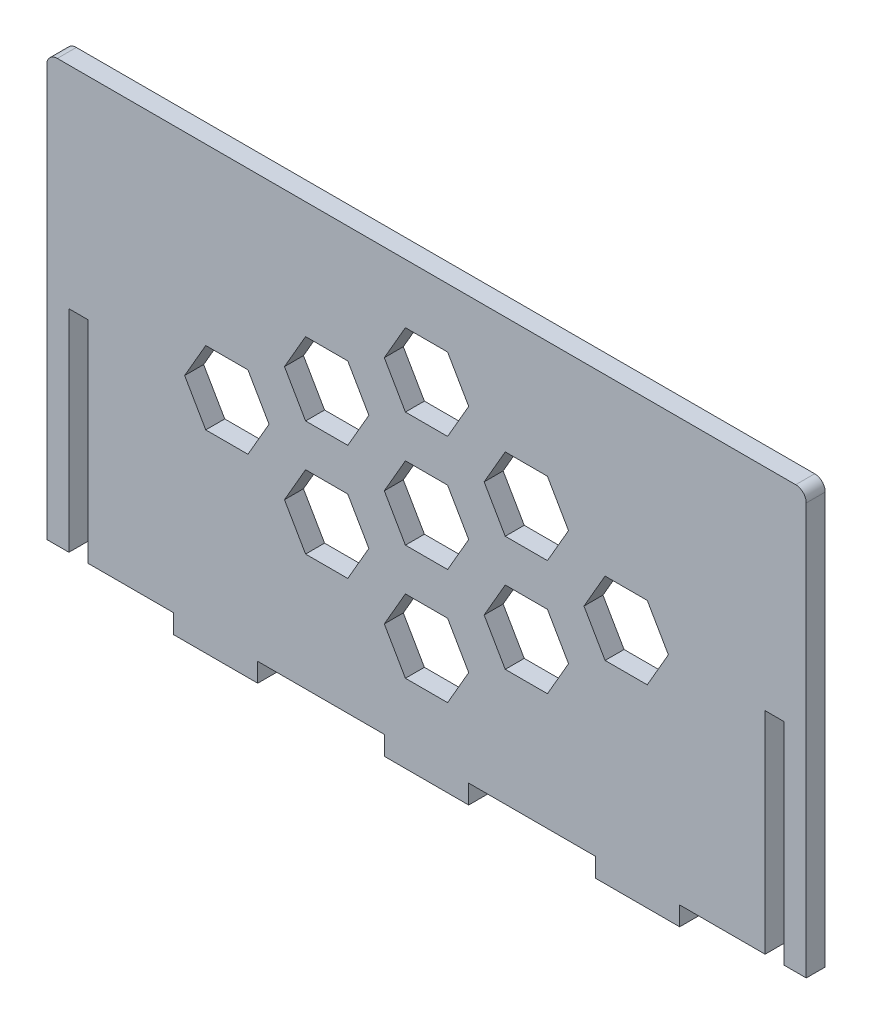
ISO-10303-21;
HEADER;
FILE_DESCRIPTION(('STEP AP214'),'2;1');
FILE_NAME('part.step','',(''),(''),'','','');
FILE_SCHEMA(('AUTOMOTIVE_DESIGN { 1 0 10303 214 1 1 1 1 }'));
ENDSEC;
DATA;
#1=APPLICATION_CONTEXT('core data for automotive mechanical design processes');
#2=APPLICATION_PROTOCOL_DEFINITION('international standard','automotive_design',2000,#1);
#3=PRODUCT_CONTEXT('',#1,'mechanical');
#4=PRODUCT('Part','Part','',(#3));
#5=PRODUCT_RELATED_PRODUCT_CATEGORY('part','',(#4));
#6=PRODUCT_DEFINITION_FORMATION('','',#4);
#7=PRODUCT_DEFINITION_CONTEXT('part definition',#1,'design');
#8=PRODUCT_DEFINITION('design','',#6,#7);
#9=PRODUCT_DEFINITION_SHAPE('','',#8);
#10=(LENGTH_UNIT() NAMED_UNIT(*) SI_UNIT(.MILLI.,.METRE.));
#11=(NAMED_UNIT(*) PLANE_ANGLE_UNIT() SI_UNIT($,.RADIAN.));
#12=(NAMED_UNIT(*) SI_UNIT($,.STERADIAN.) SOLID_ANGLE_UNIT());
#13=UNCERTAINTY_MEASURE_WITH_UNIT(LENGTH_MEASURE(1.E-05),#10,'distance_accuracy_value','');
#14=(GEOMETRIC_REPRESENTATION_CONTEXT(3) GLOBAL_UNCERTAINTY_ASSIGNED_CONTEXT((#13)) GLOBAL_UNIT_ASSIGNED_CONTEXT((#10,
#11,#12)) REPRESENTATION_CONTEXT('',''));
#15=CARTESIAN_POINT('',(0.,0.,0.));
#16=DIRECTION('',(0.,0.,1.));
#17=DIRECTION('',(1.,0.,0.));
#18=AXIS2_PLACEMENT_3D('',#15,#16,#17);
#19=CARTESIAN_POINT('',(-360.,-200.,18.));
#20=DIRECTION('',(0.,1.,0.));
#21=DIRECTION('',(0.,0.,1.));
#22=AXIS2_PLACEMENT_3D('',#19,#20,#21);
#23=PLANE('',#22);
#24=DIRECTION('',(1.,0.,0.));
#25=VECTOR('',#24,1.);
#26=CARTESIAN_POINT('',(-360.,-200.,0.));
#27=LINE('',#26,#25);
#28=CARTESIAN_POINT('',(240.,-200.,0.));
#29=VERTEX_POINT('',#28);
#30=CARTESIAN_POINT('',(321.,-200.,0.));
#31=VERTEX_POINT('',#30);
#32=EDGE_CURVE('E1171',#29,#31,#27,.T.);
#33=ORIENTED_EDGE('',*,*,#32,.T.);
#34=DIRECTION('',(0.,0.,1.));
#35=VECTOR('',#34,1.);
#36=CARTESIAN_POINT('',(321.,-200.,0.));
#37=LINE('',#36,#35);
#38=CARTESIAN_POINT('',(321.,-200.,18.));
#39=VERTEX_POINT('',#38);
#40=EDGE_CURVE('E987',#31,#39,#37,.T.);
#41=ORIENTED_EDGE('',*,*,#40,.T.);
#42=DIRECTION('',(1.,0.,0.));
#43=VECTOR('',#42,1.);
#44=CARTESIAN_POINT('',(-360.,-200.,18.));
#45=LINE('',#44,#43);
#46=CARTESIAN_POINT('',(240.,-200.,18.));
#47=VERTEX_POINT('',#46);
#48=EDGE_CURVE('E1200',#47,#39,#45,.T.);
#49=ORIENTED_EDGE('',*,*,#48,.F.);
#50=DIRECTION('',(0.,0.,1.));
#51=VECTOR('',#50,1.);
#52=CARTESIAN_POINT('',(240.,-200.,0.));
#53=LINE('',#52,#51);
#54=EDGE_CURVE('E1032',#29,#47,#53,.T.);
#55=ORIENTED_EDGE('',*,*,#54,.F.);
#56=EDGE_LOOP('',(#33,#41,#49,#55));
#57=FACE_BOUND('',#56,.T.);
#58=ADVANCED_FACE('F33',(#57),#23,.F.);
#59=CARTESIAN_POINT('',(-360.,-200.,0.));
#60=VERTEX_POINT('',#59);
#61=CARTESIAN_POINT('',(-339.,-200.,0.));
#62=VERTEX_POINT('',#61);
#63=EDGE_CURVE('E1106',#60,#62,#27,.T.);
#64=ORIENTED_EDGE('',*,*,#63,.T.);
#65=DIRECTION('',(0.,0.,1.));
#66=VECTOR('',#65,1.);
#67=CARTESIAN_POINT('',(-339.,-200.,0.));
#68=LINE('',#67,#66);
#69=CARTESIAN_POINT('',(-339.,-200.,18.));
#70=VERTEX_POINT('',#69);
#71=EDGE_CURVE('E1006',#62,#70,#68,.T.);
#72=ORIENTED_EDGE('',*,*,#71,.T.);
#73=CARTESIAN_POINT('',(-360.,-200.,18.));
#74=VERTEX_POINT('',#73);
#75=EDGE_CURVE('E1112',#74,#70,#45,.T.);
#76=ORIENTED_EDGE('',*,*,#75,.F.);
#77=DIRECTION('',(0.,0.,-1.));
#78=VECTOR('',#77,1.);
#79=CARTESIAN_POINT('',(-360.,-200.,18.));
#80=LINE('',#79,#78);
#81=EDGE_CURVE('E1132',#74,#60,#80,.T.);
#82=ORIENTED_EDGE('',*,*,#81,.T.);
#83=EDGE_LOOP('',(#64,#72,#76,#82));
#84=FACE_BOUND('',#83,.T.);
#85=ADVANCED_FACE('F1229',(#84),#23,.F.);
#86=CARTESIAN_POINT('',(339.,-200.,18.));
#87=VERTEX_POINT('',#86);
#88=CARTESIAN_POINT('',(360.,-200.,18.));
#89=VERTEX_POINT('',#88);
#90=EDGE_CURVE('E1111',#87,#89,#45,.T.);
#91=ORIENTED_EDGE('',*,*,#90,.F.);
#92=DIRECTION('',(0.,0.,1.));
#93=VECTOR('',#92,1.);
#94=CARTESIAN_POINT('',(339.,-200.,0.));
#95=LINE('',#94,#93);
#96=CARTESIAN_POINT('',(339.,-200.,0.));
#97=VERTEX_POINT('',#96);
#98=EDGE_CURVE('E980',#97,#87,#95,.T.);
#99=ORIENTED_EDGE('',*,*,#98,.F.);
#100=CARTESIAN_POINT('',(360.,-200.,0.));
#101=VERTEX_POINT('',#100);
#102=EDGE_CURVE('E1125',#97,#101,#27,.T.);
#103=ORIENTED_EDGE('',*,*,#102,.T.);
#104=DIRECTION('',(0.,0.,-1.));
#105=VECTOR('',#104,1.);
#106=CARTESIAN_POINT('',(360.,-200.,18.));
#107=LINE('',#106,#105);
#108=EDGE_CURVE('E1115',#89,#101,#107,.T.);
#109=ORIENTED_EDGE('',*,*,#108,.F.);
#110=EDGE_LOOP('',(#91,#99,#103,#109));
#111=FACE_BOUND('',#110,.T.);
#112=ADVANCED_FACE('F1169',(#111),#23,.F.);
#113=CARTESIAN_POINT('',(40.,-200.,0.));
#114=VERTEX_POINT('',#113);
#115=CARTESIAN_POINT('',(160.,-200.,0.));
#116=VERTEX_POINT('',#115);
#117=EDGE_CURVE('E1173',#114,#116,#27,.T.);
#118=ORIENTED_EDGE('',*,*,#117,.T.);
#119=DIRECTION('',(0.,0.,1.));
#120=VECTOR('',#119,1.);
#121=CARTESIAN_POINT('',(160.,-200.,0.));
#122=LINE('',#121,#120);
#123=CARTESIAN_POINT('',(160.,-200.,18.));
#124=VERTEX_POINT('',#123);
#125=EDGE_CURVE('E1045',#116,#124,#122,.T.);
#126=ORIENTED_EDGE('',*,*,#125,.T.);
#127=CARTESIAN_POINT('',(39.9999999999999,-200.,18.));
#128=VERTEX_POINT('',#127);
#129=EDGE_CURVE('E1198',#128,#124,#45,.T.);
#130=ORIENTED_EDGE('',*,*,#129,.F.);
#131=DIRECTION('',(0.,0.,1.));
#132=VECTOR('',#131,1.);
#133=CARTESIAN_POINT('',(40.,-200.,0.));
#134=LINE('',#133,#132);
#135=EDGE_CURVE('E1059',#114,#128,#134,.T.);
#136=ORIENTED_EDGE('',*,*,#135,.F.);
#137=EDGE_LOOP('',(#118,#126,#130,#136));
#138=FACE_BOUND('',#137,.T.);
#139=ADVANCED_FACE('F1185',(#138),#23,.F.);
#140=CARTESIAN_POINT('',(-160.,-200.,0.));
#141=VERTEX_POINT('',#140);
#142=CARTESIAN_POINT('',(-40.,-200.,0.));
#143=VERTEX_POINT('',#142);
#144=EDGE_CURVE('E1129',#141,#143,#27,.T.);
#145=ORIENTED_EDGE('',*,*,#144,.T.);
#146=DIRECTION('',(0.,0.,1.));
#147=VECTOR('',#146,1.);
#148=CARTESIAN_POINT('',(-39.9999999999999,-200.,0.));
#149=LINE('',#148,#147);
#150=CARTESIAN_POINT('',(-40.,-200.,18.));
#151=VERTEX_POINT('',#150);
#152=EDGE_CURVE('E1072',#143,#151,#149,.T.);
#153=ORIENTED_EDGE('',*,*,#152,.T.);
#154=CARTESIAN_POINT('',(-160.,-200.,18.));
#155=VERTEX_POINT('',#154);
#156=EDGE_CURVE('E1117',#155,#151,#45,.T.);
#157=ORIENTED_EDGE('',*,*,#156,.F.);
#158=DIRECTION('',(0.,0.,1.));
#159=VECTOR('',#158,1.);
#160=CARTESIAN_POINT('',(-160.,-200.,0.));
#161=LINE('',#160,#159);
#162=EDGE_CURVE('E1085',#141,#155,#161,.T.);
#163=ORIENTED_EDGE('',*,*,#162,.F.);
#164=EDGE_LOOP('',(#145,#153,#157,#163));
#165=FACE_BOUND('',#164,.T.);
#166=ADVANCED_FACE('F1216',(#165),#23,.F.);
#167=CARTESIAN_POINT('',(360.,200.,18.));
#168=DIRECTION('',(-1.,0.,0.));
#169=DIRECTION('',(0.,0.,1.));
#170=AXIS2_PLACEMENT_3D('',#167,#168,#169);
#171=PLANE('',#170);
#172=DIRECTION('',(0.,1.,0.));
#173=VECTOR('',#172,1.);
#174=CARTESIAN_POINT('',(360.,200.,0.));
#175=LINE('',#174,#173);
#176=CARTESIAN_POINT('',(360.,190.,0.));
#177=VERTEX_POINT('',#176);
#178=EDGE_CURVE('E1095',#101,#177,#175,.T.);
#179=ORIENTED_EDGE('',*,*,#178,.T.);
#180=DIRECTION('',(0.,0.,-1.));
#181=VECTOR('',#180,1.);
#182=CARTESIAN_POINT('',(360.,190.,18.));
#183=LINE('',#182,#181);
#184=CARTESIAN_POINT('',(360.,190.,18.));
#185=VERTEX_POINT('',#184);
#186=EDGE_CURVE('E1144',#177,#185,#183,.F.);
#187=ORIENTED_EDGE('',*,*,#186,.T.);
#188=DIRECTION('',(0.,1.,0.));
#189=VECTOR('',#188,1.);
#190=CARTESIAN_POINT('',(360.,200.,18.));
#191=LINE('',#190,#189);
#192=EDGE_CURVE('E1102',#89,#185,#191,.T.);
#193=ORIENTED_EDGE('',*,*,#192,.F.);
#194=ORIENTED_EDGE('',*,*,#108,.T.);
#195=EDGE_LOOP('',(#179,#187,#193,#194));
#196=FACE_BOUND('',#195,.T.);
#197=ADVANCED_FACE('F1165',(#196),#171,.F.);
#198=CARTESIAN_POINT('',(-360.,200.,18.));
#199=DIRECTION('',(0.,-1.,0.));
#200=DIRECTION('',(0.,0.,-1.));
#201=AXIS2_PLACEMENT_3D('',#198,#199,#200);
#202=PLANE('',#201);
#203=DIRECTION('',(-1.,0.,0.));
#204=VECTOR('',#203,1.);
#205=CARTESIAN_POINT('',(-360.,200.,18.));
#206=LINE('',#205,#204);
#207=CARTESIAN_POINT('',(350.,200.,18.));
#208=VERTEX_POINT('',#207);
#209=CARTESIAN_POINT('',(-350.,200.,18.));
#210=VERTEX_POINT('',#209);
#211=EDGE_CURVE('E1105',#208,#210,#206,.T.);
#212=ORIENTED_EDGE('',*,*,#211,.F.);
#213=DIRECTION('',(0.,0.,-1.));
#214=VECTOR('',#213,1.);
#215=CARTESIAN_POINT('',(350.,200.,18.));
#216=LINE('',#215,#214);
#217=CARTESIAN_POINT('',(350.,200.,0.));
#218=VERTEX_POINT('',#217);
#219=EDGE_CURVE('E1137',#208,#218,#216,.T.);
#220=ORIENTED_EDGE('',*,*,#219,.T.);
#221=DIRECTION('',(-1.,0.,0.));
#222=VECTOR('',#221,1.);
#223=CARTESIAN_POINT('',(-360.,200.,0.));
#224=LINE('',#223,#222);
#225=CARTESIAN_POINT('',(-350.,200.,0.));
#226=VERTEX_POINT('',#225);
#227=EDGE_CURVE('E1120',#218,#226,#224,.T.);
#228=ORIENTED_EDGE('',*,*,#227,.T.);
#229=DIRECTION('',(0.,0.,-1.));
#230=VECTOR('',#229,1.);
#231=CARTESIAN_POINT('',(-350.,200.,18.));
#232=LINE('',#231,#230);
#233=EDGE_CURVE('E1135',#226,#210,#232,.F.);
#234=ORIENTED_EDGE('',*,*,#233,.T.);
#235=EDGE_LOOP('',(#212,#220,#228,#234));
#236=FACE_BOUND('',#235,.T.);
#237=ADVANCED_FACE('F1157',(#236),#202,.F.);
#238=CARTESIAN_POINT('',(-360.,200.,18.));
#239=DIRECTION('',(1.,0.,0.));
#240=DIRECTION('',(0.,0.,-1.));
#241=AXIS2_PLACEMENT_3D('',#238,#239,#240);
#242=PLANE('',#241);
#243=DIRECTION('',(0.,-1.,0.));
#244=VECTOR('',#243,1.);
#245=CARTESIAN_POINT('',(-360.,200.,18.));
#246=LINE('',#245,#244);
#247=CARTESIAN_POINT('',(-360.,190.,18.));
#248=VERTEX_POINT('',#247);
#249=EDGE_CURVE('E1109',#248,#74,#246,.T.);
#250=ORIENTED_EDGE('',*,*,#249,.F.);
#251=DIRECTION('',(0.,0.,-1.));
#252=VECTOR('',#251,1.);
#253=CARTESIAN_POINT('',(-360.,190.,18.));
#254=LINE('',#253,#252);
#255=CARTESIAN_POINT('',(-360.,190.,0.));
#256=VERTEX_POINT('',#255);
#257=EDGE_CURVE('E11',#248,#256,#254,.T.);
#258=ORIENTED_EDGE('',*,*,#257,.T.);
#259=DIRECTION('',(0.,-1.,0.));
#260=VECTOR('',#259,1.);
#261=CARTESIAN_POINT('',(-360.,200.,0.));
#262=LINE('',#261,#260);
#263=EDGE_CURVE('E1123',#256,#60,#262,.T.);
#264=ORIENTED_EDGE('',*,*,#263,.T.);
#265=ORIENTED_EDGE('',*,*,#81,.F.);
#266=EDGE_LOOP('',(#250,#258,#264,#265));
#267=FACE_BOUND('',#266,.T.);
#268=ADVANCED_FACE('F1214',(#267),#242,.F.);
#269=CARTESIAN_POINT('',(-321.,-200.,18.));
#270=VERTEX_POINT('',#269);
#271=CARTESIAN_POINT('',(-240.,-200.,18.));
#272=VERTEX_POINT('',#271);
#273=EDGE_CURVE('E1116',#270,#272,#45,.T.);
#274=ORIENTED_EDGE('',*,*,#273,.F.);
#275=DIRECTION('',(0.,0.,1.));
#276=VECTOR('',#275,1.);
#277=CARTESIAN_POINT('',(-321.,-200.,0.));
#278=LINE('',#277,#276);
#279=CARTESIAN_POINT('',(-321.,-200.,0.));
#280=VERTEX_POINT('',#279);
#281=EDGE_CURVE('E1018',#280,#270,#278,.T.);
#282=ORIENTED_EDGE('',*,*,#281,.F.);
#283=CARTESIAN_POINT('',(-240.,-200.,0.));
#284=VERTEX_POINT('',#283);
#285=EDGE_CURVE('E1128',#280,#284,#27,.T.);
#286=ORIENTED_EDGE('',*,*,#285,.T.);
#287=DIRECTION('',(0.,0.,1.));
#288=VECTOR('',#287,1.);
#289=CARTESIAN_POINT('',(-240.,-200.,0.));
#290=LINE('',#289,#288);
#291=EDGE_CURVE('E1098',#284,#272,#290,.T.);
#292=ORIENTED_EDGE('',*,*,#291,.T.);
#293=EDGE_LOOP('',(#274,#282,#286,#292));
#294=FACE_BOUND('',#293,.T.);
#295=ADVANCED_FACE('F1212',(#294),#23,.F.);
#296=CARTESIAN_POINT('',(0.,0.,18.));
#297=DIRECTION('',(0.,0.,1.));
#298=DIRECTION('',(1.,0.,0.));
#299=AXIS2_PLACEMENT_3D('',#296,#297,#298);
#300=PLANE('',#299);
#301=DIRECTION('',(1.,0.,0.));
#302=VECTOR('',#301,1.);
#303=CARTESIAN_POINT('',(-169.282032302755,-34.6410161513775,18.));
#304=LINE('',#303,#302);
#305=CARTESIAN_POINT('',(-209.282032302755,-34.6410161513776,18.));
#306=VERTEX_POINT('',#305);
#307=CARTESIAN_POINT('',(-169.282032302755,-34.6410161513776,18.));
#308=VERTEX_POINT('',#307);
#309=EDGE_CURVE('E48',#306,#308,#304,.T.);
#310=ORIENTED_EDGE('',*,*,#309,.F.);
#311=DIRECTION('',(0.499999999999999,-0.866025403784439,0.));
#312=VECTOR('',#311,1.);
#313=CARTESIAN_POINT('',(-209.282032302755,-34.6410161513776,18.));
#314=LINE('',#313,#312);
#315=CARTESIAN_POINT('',(-229.282032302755,0.,18.));
#316=VERTEX_POINT('',#315);
#317=EDGE_CURVE('E641',#316,#306,#314,.T.);
#318=ORIENTED_EDGE('',*,*,#317,.F.);
#319=DIRECTION('',(-0.5,-0.866025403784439,0.));
#320=VECTOR('',#319,1.);
#321=CARTESIAN_POINT('',(-229.282032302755,0.,18.));
#322=LINE('',#321,#320);
#323=CARTESIAN_POINT('',(-209.282032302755,34.6410161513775,18.));
#324=VERTEX_POINT('',#323);
#325=EDGE_CURVE('E668',#324,#316,#322,.T.);
#326=ORIENTED_EDGE('',*,*,#325,.F.);
#327=DIRECTION('',(-1.,0.,0.));
#328=VECTOR('',#327,1.);
#329=CARTESIAN_POINT('',(-209.282032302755,34.6410161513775,18.));
#330=LINE('',#329,#328);
#331=CARTESIAN_POINT('',(-169.282032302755,34.6410161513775,18.));
#332=VERTEX_POINT('',#331);
#333=EDGE_CURVE('E665',#332,#324,#330,.T.);
#334=ORIENTED_EDGE('',*,*,#333,.F.);
#335=DIRECTION('',(-0.500000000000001,0.866025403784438,0.));
#336=VECTOR('',#335,1.);
#337=CARTESIAN_POINT('',(-169.282032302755,34.6410161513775,18.));
#338=LINE('',#337,#336);
#339=CARTESIAN_POINT('',(-149.282032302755,0.,18.));
#340=VERTEX_POINT('',#339);
#341=EDGE_CURVE('E662',#340,#332,#338,.T.);
#342=ORIENTED_EDGE('',*,*,#341,.F.);
#343=DIRECTION('',(0.5,0.866025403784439,0.));
#344=VECTOR('',#343,1.);
#345=CARTESIAN_POINT('',(-149.282032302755,0.,18.));
#346=LINE('',#345,#344);
#347=EDGE_CURVE('E658',#308,#340,#346,.T.);
#348=ORIENTED_EDGE('',*,*,#347,.F.);
#349=EDGE_LOOP('',(#310,#318,#326,#334,#342,#348));
#350=FACE_BOUND('',#349,.T.);
#351=DIRECTION('',(-0.5,0.866025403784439,0.));
#352=VECTOR('',#351,1.);
#353=CARTESIAN_POINT('',(-54.6410161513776,-54.6410161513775,18.));
#354=LINE('',#353,#352);
#355=CARTESIAN_POINT('',(-54.6410161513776,-54.6410161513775,18.));
#356=VERTEX_POINT('',#355);
#357=CARTESIAN_POINT('',(-74.6410161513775,-20.,18.));
#358=VERTEX_POINT('',#357);
#359=EDGE_CURVE('E56',#356,#358,#354,.T.);
#360=ORIENTED_EDGE('',*,*,#359,.F.);
#361=DIRECTION('',(0.5,0.866025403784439,0.));
#362=VECTOR('',#361,1.);
#363=CARTESIAN_POINT('',(-74.6410161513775,-89.282032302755,18.));
#364=LINE('',#363,#362);
#365=CARTESIAN_POINT('',(-74.6410161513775,-89.282032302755,18.));
#366=VERTEX_POINT('',#365);
#367=EDGE_CURVE('E689',#366,#356,#364,.T.);
#368=ORIENTED_EDGE('',*,*,#367,.F.);
#369=DIRECTION('',(1.,0.,0.));
#370=VECTOR('',#369,1.);
#371=CARTESIAN_POINT('',(-114.641016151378,-89.282032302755,18.));
#372=LINE('',#371,#370);
#373=CARTESIAN_POINT('',(-114.641016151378,-89.282032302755,18.));
#374=VERTEX_POINT('',#373);
#375=EDGE_CURVE('E715',#374,#366,#372,.T.);
#376=ORIENTED_EDGE('',*,*,#375,.F.);
#377=DIRECTION('',(0.5,-0.866025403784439,0.));
#378=VECTOR('',#377,1.);
#379=CARTESIAN_POINT('',(-134.641016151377,-54.6410161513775,18.));
#380=LINE('',#379,#378);
#381=CARTESIAN_POINT('',(-134.641016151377,-54.6410161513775,18.));
#382=VERTEX_POINT('',#381);
#383=EDGE_CURVE('E712',#382,#374,#380,.T.);
#384=ORIENTED_EDGE('',*,*,#383,.F.);
#385=DIRECTION('',(-0.5,-0.866025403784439,0.));
#386=VECTOR('',#385,1.);
#387=CARTESIAN_POINT('',(-114.641016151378,-20.,18.));
#388=LINE('',#387,#386);
#389=CARTESIAN_POINT('',(-114.641016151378,-20.,18.));
#390=VERTEX_POINT('',#389);
#391=EDGE_CURVE('E709',#390,#382,#388,.T.);
#392=ORIENTED_EDGE('',*,*,#391,.F.);
#393=DIRECTION('',(-1.,0.,0.));
#394=VECTOR('',#393,1.);
#395=CARTESIAN_POINT('',(-74.6410161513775,-20.,18.));
#396=LINE('',#395,#394);
#397=EDGE_CURVE('E706',#358,#390,#396,.T.);
#398=ORIENTED_EDGE('',*,*,#397,.F.);
#399=EDGE_LOOP('',(#360,#368,#376,#384,#392,#398));
#400=FACE_BOUND('',#399,.T.);
#401=DIRECTION('',(-0.5,0.866025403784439,0.));
#402=VECTOR('',#401,1.);
#403=CARTESIAN_POINT('',(-74.6410161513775,89.282032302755,18.));
#404=LINE('',#403,#402);
#405=CARTESIAN_POINT('',(-54.6410161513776,54.6410161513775,18.));
#406=VERTEX_POINT('',#405);
#407=CARTESIAN_POINT('',(-74.6410161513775,89.282032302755,18.));
#408=VERTEX_POINT('',#407);
#409=EDGE_CURVE('E537',#406,#408,#404,.T.);
#410=ORIENTED_EDGE('',*,*,#409,.F.);
#411=DIRECTION('',(0.5,0.866025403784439,0.));
#412=VECTOR('',#411,1.);
#413=CARTESIAN_POINT('',(-54.6410161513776,54.6410161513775,18.));
#414=LINE('',#413,#412);
#415=CARTESIAN_POINT('',(-74.6410161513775,20.,18.));
#416=VERTEX_POINT('',#415);
#417=EDGE_CURVE('E556',#416,#406,#414,.T.);
#418=ORIENTED_EDGE('',*,*,#417,.F.);
#419=DIRECTION('',(1.,0.,0.));
#420=VECTOR('',#419,1.);
#421=CARTESIAN_POINT('',(-74.6410161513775,20.,18.));
#422=LINE('',#421,#420);
#423=CARTESIAN_POINT('',(-114.641016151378,20.,18.));
#424=VERTEX_POINT('',#423);
#425=EDGE_CURVE('E559',#424,#416,#422,.T.);
#426=ORIENTED_EDGE('',*,*,#425,.F.);
#427=DIRECTION('',(0.5,-0.866025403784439,0.));
#428=VECTOR('',#427,1.);
#429=CARTESIAN_POINT('',(-114.641016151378,20.,18.));
#430=LINE('',#429,#428);
#431=CARTESIAN_POINT('',(-134.641016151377,54.6410161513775,18.));
#432=VERTEX_POINT('',#431);
#433=EDGE_CURVE('E576',#432,#424,#430,.T.);
#434=ORIENTED_EDGE('',*,*,#433,.F.);
#435=DIRECTION('',(-0.5,-0.866025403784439,0.));
#436=VECTOR('',#435,1.);
#437=CARTESIAN_POINT('',(-134.641016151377,54.6410161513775,18.));
#438=LINE('',#437,#436);
#439=CARTESIAN_POINT('',(-114.641016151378,89.282032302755,18.));
#440=VERTEX_POINT('',#439);
#441=EDGE_CURVE('E573',#440,#432,#438,.T.);
#442=ORIENTED_EDGE('',*,*,#441,.F.);
#443=DIRECTION('',(-1.,0.,0.));
#444=VECTOR('',#443,1.);
#445=CARTESIAN_POINT('',(-114.641016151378,89.282032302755,18.));
#446=LINE('',#445,#444);
#447=EDGE_CURVE('E570',#408,#440,#446,.T.);
#448=ORIENTED_EDGE('',*,*,#447,.F.);
#449=EDGE_LOOP('',(#410,#418,#426,#434,#442,#448));
#450=FACE_BOUND('',#449,.T.);
#451=DIRECTION('',(1.,0.,0.));
#452=VECTOR('',#451,1.);
#453=CARTESIAN_POINT('',(209.282032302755,-34.6410161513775,18.));
#454=LINE('',#453,#452);
#455=CARTESIAN_POINT('',(169.282032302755,-34.6410161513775,18.));
#456=VERTEX_POINT('',#455);
#457=CARTESIAN_POINT('',(209.282032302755,-34.6410161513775,18.));
#458=VERTEX_POINT('',#457);
#459=EDGE_CURVE('E610',#456,#458,#454,.T.);
#460=ORIENTED_EDGE('',*,*,#459,.F.);
#461=DIRECTION('',(0.5,-0.866025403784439,0.));
#462=VECTOR('',#461,1.);
#463=CARTESIAN_POINT('',(169.282032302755,-34.6410161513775,18.));
#464=LINE('',#463,#462);
#465=CARTESIAN_POINT('',(149.282032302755,0.,18.));
#466=VERTEX_POINT('',#465);
#467=EDGE_CURVE('E594',#466,#456,#464,.T.);
#468=ORIENTED_EDGE('',*,*,#467,.F.);
#469=DIRECTION('',(-0.500000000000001,-0.866025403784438,0.));
#470=VECTOR('',#469,1.);
#471=CARTESIAN_POINT('',(149.282032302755,0.,18.));
#472=LINE('',#471,#470);
#473=CARTESIAN_POINT('',(169.282032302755,34.6410161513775,18.));
#474=VERTEX_POINT('',#473);
#475=EDGE_CURVE('E621',#474,#466,#472,.T.);
#476=ORIENTED_EDGE('',*,*,#475,.F.);
#477=DIRECTION('',(-1.,0.,0.));
#478=VECTOR('',#477,1.);
#479=CARTESIAN_POINT('',(169.282032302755,34.6410161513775,18.));
#480=LINE('',#479,#478);
#481=CARTESIAN_POINT('',(209.282032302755,34.6410161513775,18.));
#482=VERTEX_POINT('',#481);
#483=EDGE_CURVE('E618',#482,#474,#480,.T.);
#484=ORIENTED_EDGE('',*,*,#483,.F.);
#485=DIRECTION('',(-0.5,0.866025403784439,0.));
#486=VECTOR('',#485,1.);
#487=CARTESIAN_POINT('',(209.282032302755,34.6410161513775,18.));
#488=LINE('',#487,#486);
#489=CARTESIAN_POINT('',(229.282032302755,0.,18.));
#490=VERTEX_POINT('',#489);
#491=EDGE_CURVE('E615',#490,#482,#488,.T.);
#492=ORIENTED_EDGE('',*,*,#491,.F.);
#493=DIRECTION('',(0.5,0.866025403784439,0.));
#494=VECTOR('',#493,1.);
#495=CARTESIAN_POINT('',(229.282032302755,0.,18.));
#496=LINE('',#495,#494);
#497=EDGE_CURVE('E612',#458,#490,#496,.T.);
#498=ORIENTED_EDGE('',*,*,#497,.F.);
#499=EDGE_LOOP('',(#460,#468,#476,#484,#492,#498));
#500=FACE_BOUND('',#499,.T.);
#501=DIRECTION('',(-1.,0.,0.));
#502=VECTOR('',#501,1.);
#503=CARTESIAN_POINT('',(-20.,-74.6410161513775,18.));
#504=LINE('',#503,#502);
#505=CARTESIAN_POINT('',(20.,-74.6410161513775,18.));
#506=VERTEX_POINT('',#505);
#507=CARTESIAN_POINT('',(-20.,-74.6410161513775,18.));
#508=VERTEX_POINT('',#507);
#509=EDGE_CURVE('E675',#506,#508,#504,.T.);
#510=ORIENTED_EDGE('',*,*,#509,.F.);
#511=DIRECTION('',(-0.5,0.866025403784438,0.));
#512=VECTOR('',#511,1.);
#513=CARTESIAN_POINT('',(20.,-74.6410161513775,18.));
#514=LINE('',#513,#512);
#515=CARTESIAN_POINT('',(40.,-109.282032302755,18.));
#516=VERTEX_POINT('',#515);
#517=EDGE_CURVE('E880',#516,#506,#514,.T.);
#518=ORIENTED_EDGE('',*,*,#517,.F.);
#519=DIRECTION('',(0.5,0.866025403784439,0.));
#520=VECTOR('',#519,1.);
#521=CARTESIAN_POINT('',(40.,-109.282032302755,18.));
#522=LINE('',#521,#520);
#523=CARTESIAN_POINT('',(20.,-143.923048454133,18.));
#524=VERTEX_POINT('',#523);
#525=EDGE_CURVE('E906',#524,#516,#522,.T.);
#526=ORIENTED_EDGE('',*,*,#525,.F.);
#527=DIRECTION('',(1.,0.,0.));
#528=VECTOR('',#527,1.);
#529=CARTESIAN_POINT('',(20.,-143.923048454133,18.));
#530=LINE('',#529,#528);
#531=CARTESIAN_POINT('',(-20.,-143.923048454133,18.));
#532=VERTEX_POINT('',#531);
#533=EDGE_CURVE('E903',#532,#524,#530,.T.);
#534=ORIENTED_EDGE('',*,*,#533,.F.);
#535=DIRECTION('',(0.5,-0.866025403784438,0.));
#536=VECTOR('',#535,1.);
#537=CARTESIAN_POINT('',(-20.,-143.923048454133,18.));
#538=LINE('',#537,#536);
#539=CARTESIAN_POINT('',(-40.,-109.282032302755,18.));
#540=VERTEX_POINT('',#539);
#541=EDGE_CURVE('E900',#540,#532,#538,.T.);
#542=ORIENTED_EDGE('',*,*,#541,.F.);
#543=DIRECTION('',(-0.500000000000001,-0.866025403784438,0.));
#544=VECTOR('',#543,1.);
#545=CARTESIAN_POINT('',(-40.,-109.282032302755,18.));
#546=LINE('',#545,#544);
#547=EDGE_CURVE('E897',#508,#540,#546,.T.);
#548=ORIENTED_EDGE('',*,*,#547,.F.);
#549=EDGE_LOOP('',(#510,#518,#526,#534,#542,#548));
#550=FACE_BOUND('',#549,.T.);
#551=DIRECTION('',(-1.,0.,0.));
#552=VECTOR('',#551,1.);
#553=CARTESIAN_POINT('',(-20.,143.923048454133,18.));
#554=LINE('',#553,#552);
#555=CARTESIAN_POINT('',(20.,143.923048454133,18.));
#556=VERTEX_POINT('',#555);
#557=CARTESIAN_POINT('',(-20.,143.923048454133,18.));
#558=VERTEX_POINT('',#557);
#559=EDGE_CURVE('E848',#556,#558,#554,.T.);
#560=ORIENTED_EDGE('',*,*,#559,.F.);
#561=DIRECTION('',(-0.5,0.866025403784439,0.));
#562=VECTOR('',#561,1.);
#563=CARTESIAN_POINT('',(20.,143.923048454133,18.));
#564=LINE('',#563,#562);
#565=CARTESIAN_POINT('',(40.,109.282032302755,18.));
#566=VERTEX_POINT('',#565);
#567=EDGE_CURVE('E832',#566,#556,#564,.T.);
#568=ORIENTED_EDGE('',*,*,#567,.F.);
#569=DIRECTION('',(0.5,0.866025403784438,0.));
#570=VECTOR('',#569,1.);
#571=CARTESIAN_POINT('',(40.,109.282032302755,18.));
#572=LINE('',#571,#570);
#573=CARTESIAN_POINT('',(20.,74.6410161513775,18.));
#574=VERTEX_POINT('',#573);
#575=EDGE_CURVE('E860',#574,#566,#572,.T.);
#576=ORIENTED_EDGE('',*,*,#575,.F.);
#577=DIRECTION('',(1.,0.,0.));
#578=VECTOR('',#577,1.);
#579=CARTESIAN_POINT('',(20.,74.6410161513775,18.));
#580=LINE('',#579,#578);
#581=CARTESIAN_POINT('',(-20.,74.6410161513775,18.));
#582=VERTEX_POINT('',#581);
#583=EDGE_CURVE('E857',#582,#574,#580,.T.);
#584=ORIENTED_EDGE('',*,*,#583,.F.);
#585=DIRECTION('',(0.500000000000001,-0.866025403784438,0.));
#586=VECTOR('',#585,1.);
#587=CARTESIAN_POINT('',(-20.,74.6410161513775,18.));
#588=LINE('',#587,#586);
#589=CARTESIAN_POINT('',(-40.,109.282032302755,18.));
#590=VERTEX_POINT('',#589);
#591=EDGE_CURVE('E854',#590,#582,#588,.T.);
#592=ORIENTED_EDGE('',*,*,#591,.F.);
#593=DIRECTION('',(-0.5,-0.866025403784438,0.));
#594=VECTOR('',#593,1.);
#595=CARTESIAN_POINT('',(-40.,109.282032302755,18.));
#596=LINE('',#595,#594);
#597=EDGE_CURVE('E850',#558,#590,#596,.T.);
#598=ORIENTED_EDGE('',*,*,#597,.F.);
#599=EDGE_LOOP('',(#560,#568,#576,#584,#592,#598));
#600=FACE_BOUND('',#599,.T.);
#601=DIRECTION('',(0.5,-0.866025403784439,0.));
#602=VECTOR('',#601,1.);
#603=CARTESIAN_POINT('',(74.6410161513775,-89.282032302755,18.));
#604=LINE('',#603,#602);
#605=CARTESIAN_POINT('',(54.6410161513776,-54.6410161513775,18.));
#606=VERTEX_POINT('',#605);
#607=CARTESIAN_POINT('',(74.6410161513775,-89.282032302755,18.));
#608=VERTEX_POINT('',#607);
#609=EDGE_CURVE('E800',#606,#608,#604,.T.);
#610=ORIENTED_EDGE('',*,*,#609,.F.);
#611=DIRECTION('',(-0.5,-0.866025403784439,0.));
#612=VECTOR('',#611,1.);
#613=CARTESIAN_POINT('',(54.6410161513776,-54.6410161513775,18.));
#614=LINE('',#613,#612);
#615=CARTESIAN_POINT('',(74.6410161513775,-20.,18.));
#616=VERTEX_POINT('',#615);
#617=EDGE_CURVE('E784',#616,#606,#614,.T.);
#618=ORIENTED_EDGE('',*,*,#617,.F.);
#619=DIRECTION('',(-1.,0.,0.));
#620=VECTOR('',#619,1.);
#621=CARTESIAN_POINT('',(74.6410161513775,-20.,18.));
#622=LINE('',#621,#620);
#623=CARTESIAN_POINT('',(114.641016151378,-20.,18.));
#624=VERTEX_POINT('',#623);
#625=EDGE_CURVE('E812',#624,#616,#622,.T.);
#626=ORIENTED_EDGE('',*,*,#625,.F.);
#627=DIRECTION('',(-0.5,0.866025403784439,0.));
#628=VECTOR('',#627,1.);
#629=CARTESIAN_POINT('',(114.641016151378,-20.,18.));
#630=LINE('',#629,#628);
#631=CARTESIAN_POINT('',(134.641016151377,-54.6410161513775,18.));
#632=VERTEX_POINT('',#631);
#633=EDGE_CURVE('E809',#632,#624,#630,.T.);
#634=ORIENTED_EDGE('',*,*,#633,.F.);
#635=DIRECTION('',(0.5,0.866025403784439,0.));
#636=VECTOR('',#635,1.);
#637=CARTESIAN_POINT('',(134.641016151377,-54.6410161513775,18.));
#638=LINE('',#637,#636);
#639=CARTESIAN_POINT('',(114.641016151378,-89.282032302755,18.));
#640=VERTEX_POINT('',#639);
#641=EDGE_CURVE('E806',#640,#632,#638,.T.);
#642=ORIENTED_EDGE('',*,*,#641,.F.);
#643=DIRECTION('',(1.,0.,0.));
#644=VECTOR('',#643,1.);
#645=CARTESIAN_POINT('',(114.641016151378,-89.282032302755,18.));
#646=LINE('',#645,#644);
#647=EDGE_CURVE('E802',#608,#640,#646,.T.);
#648=ORIENTED_EDGE('',*,*,#647,.F.);
#649=EDGE_LOOP('',(#610,#618,#626,#634,#642,#648));
#650=FACE_BOUND('',#649,.T.);
#651=DIRECTION('',(0.5,-0.866025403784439,0.));
#652=VECTOR('',#651,1.);
#653=CARTESIAN_POINT('',(54.6410161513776,54.6410161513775,18.));
#654=LINE('',#653,#652);
#655=CARTESIAN_POINT('',(54.6410161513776,54.6410161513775,18.));
#656=VERTEX_POINT('',#655);
#657=CARTESIAN_POINT('',(74.6410161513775,20.,18.));
#658=VERTEX_POINT('',#657);
#659=EDGE_CURVE('E750',#656,#658,#654,.T.);
#660=ORIENTED_EDGE('',*,*,#659,.F.);
#661=DIRECTION('',(-0.5,-0.866025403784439,0.));
#662=VECTOR('',#661,1.);
#663=CARTESIAN_POINT('',(74.6410161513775,89.282032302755,18.));
#664=LINE('',#663,#662);
#665=CARTESIAN_POINT('',(74.6410161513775,89.282032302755,18.));
#666=VERTEX_POINT('',#665);
#667=EDGE_CURVE('E734',#666,#656,#664,.T.);
#668=ORIENTED_EDGE('',*,*,#667,.F.);
#669=DIRECTION('',(-1.,0.,0.));
#670=VECTOR('',#669,1.);
#671=CARTESIAN_POINT('',(114.641016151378,89.282032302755,18.));
#672=LINE('',#671,#670);
#673=CARTESIAN_POINT('',(114.641016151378,89.282032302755,18.));
#674=VERTEX_POINT('',#673);
#675=EDGE_CURVE('E762',#674,#666,#672,.T.);
#676=ORIENTED_EDGE('',*,*,#675,.F.);
#677=DIRECTION('',(-0.5,0.866025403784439,0.));
#678=VECTOR('',#677,1.);
#679=CARTESIAN_POINT('',(134.641016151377,54.6410161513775,18.));
#680=LINE('',#679,#678);
#681=CARTESIAN_POINT('',(134.641016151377,54.6410161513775,18.));
#682=VERTEX_POINT('',#681);
#683=EDGE_CURVE('E759',#682,#674,#680,.T.);
#684=ORIENTED_EDGE('',*,*,#683,.F.);
#685=DIRECTION('',(0.5,0.866025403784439,0.));
#686=VECTOR('',#685,1.);
#687=CARTESIAN_POINT('',(114.641016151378,20.,18.));
#688=LINE('',#687,#686);
#689=CARTESIAN_POINT('',(114.641016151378,20.,18.));
#690=VERTEX_POINT('',#689);
#691=EDGE_CURVE('E756',#690,#682,#688,.T.);
#692=ORIENTED_EDGE('',*,*,#691,.F.);
#693=DIRECTION('',(1.,0.,0.));
#694=VECTOR('',#693,1.);
#695=CARTESIAN_POINT('',(74.6410161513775,20.,18.));
#696=LINE('',#695,#694);
#697=EDGE_CURVE('E752',#658,#690,#696,.T.);
#698=ORIENTED_EDGE('',*,*,#697,.F.);
#699=EDGE_LOOP('',(#660,#668,#676,#684,#692,#698));
#700=FACE_BOUND('',#699,.T.);
#701=DIRECTION('',(0.5,0.866025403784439,0.));
#702=VECTOR('',#701,1.);
#703=CARTESIAN_POINT('',(20.,-34.6410161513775,18.));
#704=LINE('',#703,#702);
#705=CARTESIAN_POINT('',(20.,-34.6410161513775,18.));
#706=VERTEX_POINT('',#705);
#707=CARTESIAN_POINT('',(40.,0.,18.));
#708=VERTEX_POINT('',#707);
#709=EDGE_CURVE('E769',#706,#708,#704,.T.);
#710=ORIENTED_EDGE('',*,*,#709,.F.);
#711=DIRECTION('',(1.,0.,0.));
#712=VECTOR('',#711,1.);
#713=CARTESIAN_POINT('',(-20.,-34.6410161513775,18.));
#714=LINE('',#713,#712);
#715=CARTESIAN_POINT('',(-20.,-34.6410161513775,18.));
#716=VERTEX_POINT('',#715);
#717=EDGE_CURVE('E926',#716,#706,#714,.T.);
#718=ORIENTED_EDGE('',*,*,#717,.F.);
#719=DIRECTION('',(0.5,-0.866025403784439,0.));
#720=VECTOR('',#719,1.);
#721=CARTESIAN_POINT('',(-40.,0.,18.));
#722=LINE('',#721,#720);
#723=CARTESIAN_POINT('',(-40.,0.,18.));
#724=VERTEX_POINT('',#723);
#725=EDGE_CURVE('E952',#724,#716,#722,.T.);
#726=ORIENTED_EDGE('',*,*,#725,.F.);
#727=DIRECTION('',(-0.5,-0.866025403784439,0.));
#728=VECTOR('',#727,1.);
#729=CARTESIAN_POINT('',(-20.,34.6410161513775,18.));
#730=LINE('',#729,#728);
#731=CARTESIAN_POINT('',(-20.,34.6410161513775,18.));
#732=VERTEX_POINT('',#731);
#733=EDGE_CURVE('E949',#732,#724,#730,.T.);
#734=ORIENTED_EDGE('',*,*,#733,.F.);
#735=DIRECTION('',(-1.,0.,0.));
#736=VECTOR('',#735,1.);
#737=CARTESIAN_POINT('',(20.,34.6410161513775,18.));
#738=LINE('',#737,#736);
#739=CARTESIAN_POINT('',(20.,34.6410161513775,18.));
#740=VERTEX_POINT('',#739);
#741=EDGE_CURVE('E946',#740,#732,#738,.T.);
#742=ORIENTED_EDGE('',*,*,#741,.F.);
#743=DIRECTION('',(-0.5,0.866025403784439,0.));
#744=VECTOR('',#743,1.);
#745=CARTESIAN_POINT('',(40.,0.,18.));
#746=LINE('',#745,#744);
#747=EDGE_CURVE('E943',#708,#740,#746,.T.);
#748=ORIENTED_EDGE('',*,*,#747,.F.);
#749=EDGE_LOOP('',(#710,#718,#726,#734,#742,#748));
#750=FACE_BOUND('',#749,.T.);
#751=ORIENTED_EDGE('',*,*,#192,.T.);
#752=CARTESIAN_POINT('',(350.,190.,18.));
#753=DIRECTION('',(0.,0.,1.));
#754=DIRECTION('',(1.,0.,0.));
#755=AXIS2_PLACEMENT_3D('',#752,#753,#754);
#756=CIRCLE('',#755,10.);
#757=EDGE_CURVE('E41',#185,#208,#756,.T.);
#758=ORIENTED_EDGE('',*,*,#757,.T.);
#759=ORIENTED_EDGE('',*,*,#211,.T.);
#760=CARTESIAN_POINT('',(-350.,190.,18.));
#761=DIRECTION('',(0.,0.,1.));
#762=DIRECTION('',(1.,0.,0.));
#763=AXIS2_PLACEMENT_3D('',#760,#761,#762);
#764=CIRCLE('',#763,10.);
#765=EDGE_CURVE('E1146',#210,#248,#764,.T.);
#766=ORIENTED_EDGE('',*,*,#765,.T.);
#767=ORIENTED_EDGE('',*,*,#249,.T.);
#768=ORIENTED_EDGE('',*,*,#75,.T.);
#769=DIRECTION('',(0.,-1.,0.));
#770=VECTOR('',#769,1.);
#771=CARTESIAN_POINT('',(-339.,-200.,18.));
#772=LINE('',#771,#770);
#773=CARTESIAN_POINT('',(-339.,0.,18.));
#774=VERTEX_POINT('',#773);
#775=EDGE_CURVE('E990',#774,#70,#772,.T.);
#776=ORIENTED_EDGE('',*,*,#775,.F.);
#777=DIRECTION('',(-1.,0.,0.));
#778=VECTOR('',#777,1.);
#779=CARTESIAN_POINT('',(-339.,0.,18.));
#780=LINE('',#779,#778);
#781=CARTESIAN_POINT('',(-321.,0.,18.));
#782=VERTEX_POINT('',#781);
#783=EDGE_CURVE('E1000',#782,#774,#780,.T.);
#784=ORIENTED_EDGE('',*,*,#783,.F.);
#785=DIRECTION('',(0.,1.,0.));
#786=VECTOR('',#785,1.);
#787=CARTESIAN_POINT('',(-321.,-200.,18.));
#788=LINE('',#787,#786);
#789=EDGE_CURVE('E1008',#270,#782,#788,.T.);
#790=ORIENTED_EDGE('',*,*,#789,.F.);
#791=ORIENTED_EDGE('',*,*,#273,.T.);
#792=DIRECTION('',(0.,-1.,0.));
#793=VECTOR('',#792,1.);
#794=CARTESIAN_POINT('',(-240.,-218.,18.));
#795=LINE('',#794,#793);
#796=CARTESIAN_POINT('',(-240.,-218.,18.));
#797=VERTEX_POINT('',#796);
#798=EDGE_CURVE('E1088',#272,#797,#795,.T.);
#799=ORIENTED_EDGE('',*,*,#798,.T.);
#800=DIRECTION('',(1.,0.,0.));
#801=VECTOR('',#800,1.);
#802=CARTESIAN_POINT('',(-240.,-218.,18.));
#803=LINE('',#802,#801);
#804=CARTESIAN_POINT('',(-160.,-218.,18.));
#805=VERTEX_POINT('',#804);
#806=EDGE_CURVE('E1079',#797,#805,#803,.T.);
#807=ORIENTED_EDGE('',*,*,#806,.T.);
#808=DIRECTION('',(0.,1.,0.));
#809=VECTOR('',#808,1.);
#810=CARTESIAN_POINT('',(-160.,-218.,18.));
#811=LINE('',#810,#809);
#812=EDGE_CURVE('E1069',#805,#155,#811,.T.);
#813=ORIENTED_EDGE('',*,*,#812,.T.);
#814=ORIENTED_EDGE('',*,*,#156,.T.);
#815=DIRECTION('',(0.,-1.,0.));
#816=VECTOR('',#815,1.);
#817=CARTESIAN_POINT('',(-40.,-218.,18.));
#818=LINE('',#817,#816);
#819=CARTESIAN_POINT('',(-40.,-218.,18.));
#820=VERTEX_POINT('',#819);
#821=EDGE_CURVE('E1062',#151,#820,#818,.T.);
#822=ORIENTED_EDGE('',*,*,#821,.T.);
#823=DIRECTION('',(1.,0.,0.));
#824=VECTOR('',#823,1.);
#825=CARTESIAN_POINT('',(-40.,-218.,18.));
#826=LINE('',#825,#824);
#827=CARTESIAN_POINT('',(40.,-218.,18.));
#828=VERTEX_POINT('',#827);
#829=EDGE_CURVE('E1053',#820,#828,#826,.T.);
#830=ORIENTED_EDGE('',*,*,#829,.T.);
#831=DIRECTION('',(0.,1.,0.));
#832=VECTOR('',#831,1.);
#833=CARTESIAN_POINT('',(40.,-218.,18.));
#834=LINE('',#833,#832);
#835=EDGE_CURVE('E1042',#828,#128,#834,.T.);
#836=ORIENTED_EDGE('',*,*,#835,.T.);
#837=ORIENTED_EDGE('',*,*,#129,.T.);
#838=DIRECTION('',(0.,-1.,0.));
#839=VECTOR('',#838,1.);
#840=CARTESIAN_POINT('',(160.,-218.,18.));
#841=LINE('',#840,#839);
#842=CARTESIAN_POINT('',(160.,-218.,18.));
#843=VERTEX_POINT('',#842);
#844=EDGE_CURVE('E1035',#124,#843,#841,.T.);
#845=ORIENTED_EDGE('',*,*,#844,.T.);
#846=DIRECTION('',(1.,0.,0.));
#847=VECTOR('',#846,1.);
#848=CARTESIAN_POINT('',(240.,-218.,18.));
#849=LINE('',#848,#847);
#850=CARTESIAN_POINT('',(240.,-218.,18.));
#851=VERTEX_POINT('',#850);
#852=EDGE_CURVE('E1026',#843,#851,#849,.T.);
#853=ORIENTED_EDGE('',*,*,#852,.T.);
#854=DIRECTION('',(0.,1.,0.));
#855=VECTOR('',#854,1.);
#856=CARTESIAN_POINT('',(240.,-218.,18.));
#857=LINE('',#856,#855);
#858=EDGE_CURVE('E1015',#851,#47,#857,.T.);
#859=ORIENTED_EDGE('',*,*,#858,.T.);
#860=ORIENTED_EDGE('',*,*,#48,.T.);
#861=DIRECTION('',(0.,-1.,0.));
#862=VECTOR('',#861,1.);
#863=CARTESIAN_POINT('',(321.,-200.,18.));
#864=LINE('',#863,#862);
#865=CARTESIAN_POINT('',(321.,0.,18.));
#866=VERTEX_POINT('',#865);
#867=EDGE_CURVE('E974',#866,#39,#864,.T.);
#868=ORIENTED_EDGE('',*,*,#867,.F.);
#869=DIRECTION('',(-1.,0.,0.));
#870=VECTOR('',#869,1.);
#871=CARTESIAN_POINT('',(339.,0.,18.));
#872=LINE('',#871,#870);
#873=CARTESIAN_POINT('',(339.,0.,18.));
#874=VERTEX_POINT('',#873);
#875=EDGE_CURVE('E983',#874,#866,#872,.T.);
#876=ORIENTED_EDGE('',*,*,#875,.F.);
#877=DIRECTION('',(0.,1.,0.));
#878=VECTOR('',#877,1.);
#879=CARTESIAN_POINT('',(339.,-200.,18.));
#880=LINE('',#879,#878);
#881=EDGE_CURVE('E959',#87,#874,#880,.T.);
#882=ORIENTED_EDGE('',*,*,#881,.F.);
#883=ORIENTED_EDGE('',*,*,#90,.T.);
#884=EDGE_LOOP('',(#751,#758,#759,#766,#767,#768,#776,#784,#790,#791,#799,#807,#813,#814,#822,
#830,#836,#837,#845,#853,#859,#860,#868,#876,#882,#883));
#885=FACE_BOUND('',#884,.T.);
#886=ADVANCED_FACE('F1150',(#350,#400,#450,#500,#550,#600,#650,#700,#750,#885),#300,.T.);
#887=CARTESIAN_POINT('',(0.,0.,0.));
#888=DIRECTION('',(0.,0.,1.));
#889=DIRECTION('',(1.,0.,0.));
#890=AXIS2_PLACEMENT_3D('',#887,#888,#889);
#891=PLANE('',#890);
#892=DIRECTION('',(0.499999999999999,-0.866025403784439,0.));
#893=VECTOR('',#892,1.);
#894=CARTESIAN_POINT('',(-209.282032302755,-34.6410161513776,0.));
#895=LINE('',#894,#893);
#896=CARTESIAN_POINT('',(-229.282032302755,0.,0.));
#897=VERTEX_POINT('',#896);
#898=CARTESIAN_POINT('',(-209.282032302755,-34.6410161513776,0.));
#899=VERTEX_POINT('',#898);
#900=EDGE_CURVE('E653',#897,#899,#895,.T.);
#901=ORIENTED_EDGE('',*,*,#900,.T.);
#902=DIRECTION('',(1.,0.,0.));
#903=VECTOR('',#902,1.);
#904=CARTESIAN_POINT('',(-169.282032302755,-34.6410161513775,0.));
#905=LINE('',#904,#903);
#906=CARTESIAN_POINT('',(-169.282032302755,-34.6410161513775,0.));
#907=VERTEX_POINT('',#906);
#908=EDGE_CURVE('E637',#899,#907,#905,.T.);
#909=ORIENTED_EDGE('',*,*,#908,.T.);
#910=DIRECTION('',(0.5,0.866025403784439,0.));
#911=VECTOR('',#910,1.);
#912=CARTESIAN_POINT('',(-149.282032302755,0.,0.));
#913=LINE('',#912,#911);
#914=CARTESIAN_POINT('',(-149.282032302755,0.,0.));
#915=VERTEX_POINT('',#914);
#916=EDGE_CURVE('E640',#907,#915,#913,.T.);
#917=ORIENTED_EDGE('',*,*,#916,.T.);
#918=DIRECTION('',(-0.500000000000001,0.866025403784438,0.));
#919=VECTOR('',#918,1.);
#920=CARTESIAN_POINT('',(-169.282032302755,34.6410161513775,0.));
#921=LINE('',#920,#919);
#922=CARTESIAN_POINT('',(-169.282032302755,34.6410161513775,0.));
#923=VERTEX_POINT('',#922);
#924=EDGE_CURVE('E644',#915,#923,#921,.T.);
#925=ORIENTED_EDGE('',*,*,#924,.T.);
#926=DIRECTION('',(-1.,0.,0.));
#927=VECTOR('',#926,1.);
#928=CARTESIAN_POINT('',(-209.282032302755,34.6410161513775,0.));
#929=LINE('',#928,#927);
#930=CARTESIAN_POINT('',(-209.282032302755,34.6410161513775,0.));
#931=VERTEX_POINT('',#930);
#932=EDGE_CURVE('E647',#923,#931,#929,.T.);
#933=ORIENTED_EDGE('',*,*,#932,.T.);
#934=DIRECTION('',(-0.5,-0.866025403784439,0.));
#935=VECTOR('',#934,1.);
#936=CARTESIAN_POINT('',(-229.282032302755,0.,0.));
#937=LINE('',#936,#935);
#938=EDGE_CURVE('E650',#931,#897,#937,.T.);
#939=ORIENTED_EDGE('',*,*,#938,.T.);
#940=EDGE_LOOP('',(#901,#909,#917,#925,#933,#939));
#941=FACE_BOUND('',#940,.T.);
#942=DIRECTION('',(0.5,0.866025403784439,0.));
#943=VECTOR('',#942,1.);
#944=CARTESIAN_POINT('',(-74.6410161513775,-89.282032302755,0.));
#945=LINE('',#944,#943);
#946=CARTESIAN_POINT('',(-74.6410161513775,-89.282032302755,0.));
#947=VERTEX_POINT('',#946);
#948=CARTESIAN_POINT('',(-54.6410161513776,-54.6410161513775,0.));
#949=VERTEX_POINT('',#948);
#950=EDGE_CURVE('E701',#947,#949,#945,.T.);
#951=ORIENTED_EDGE('',*,*,#950,.T.);
#952=DIRECTION('',(-0.5,0.866025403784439,0.));
#953=VECTOR('',#952,1.);
#954=CARTESIAN_POINT('',(-54.6410161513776,-54.6410161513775,0.));
#955=LINE('',#954,#953);
#956=CARTESIAN_POINT('',(-74.6410161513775,-20.,0.));
#957=VERTEX_POINT('',#956);
#958=EDGE_CURVE('E685',#949,#957,#955,.T.);
#959=ORIENTED_EDGE('',*,*,#958,.T.);
#960=DIRECTION('',(-1.,0.,0.));
#961=VECTOR('',#960,1.);
#962=CARTESIAN_POINT('',(-74.6410161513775,-20.,0.));
#963=LINE('',#962,#961);
#964=CARTESIAN_POINT('',(-114.641016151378,-20.,0.));
#965=VERTEX_POINT('',#964);
#966=EDGE_CURVE('E688',#957,#965,#963,.T.);
#967=ORIENTED_EDGE('',*,*,#966,.T.);
#968=DIRECTION('',(-0.5,-0.866025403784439,0.));
#969=VECTOR('',#968,1.);
#970=CARTESIAN_POINT('',(-114.641016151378,-20.,0.));
#971=LINE('',#970,#969);
#972=CARTESIAN_POINT('',(-134.641016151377,-54.6410161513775,0.));
#973=VERTEX_POINT('',#972);
#974=EDGE_CURVE('E692',#965,#973,#971,.T.);
#975=ORIENTED_EDGE('',*,*,#974,.T.);
#976=DIRECTION('',(0.5,-0.866025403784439,0.));
#977=VECTOR('',#976,1.);
#978=CARTESIAN_POINT('',(-134.641016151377,-54.6410161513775,0.));
#979=LINE('',#978,#977);
#980=CARTESIAN_POINT('',(-114.641016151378,-89.282032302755,0.));
#981=VERTEX_POINT('',#980);
#982=EDGE_CURVE('E695',#973,#981,#979,.T.);
#983=ORIENTED_EDGE('',*,*,#982,.T.);
#984=DIRECTION('',(1.,0.,0.));
#985=VECTOR('',#984,1.);
#986=CARTESIAN_POINT('',(-114.641016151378,-89.282032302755,0.));
#987=LINE('',#986,#985);
#988=EDGE_CURVE('E698',#981,#947,#987,.T.);
#989=ORIENTED_EDGE('',*,*,#988,.T.);
#990=EDGE_LOOP('',(#951,#959,#967,#975,#983,#989));
#991=FACE_BOUND('',#990,.T.);
#992=DIRECTION('',(0.5,0.866025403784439,0.));
#993=VECTOR('',#992,1.);
#994=CARTESIAN_POINT('',(-54.6410161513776,54.6410161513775,0.));
#995=LINE('',#994,#993);
#996=CARTESIAN_POINT('',(-74.6410161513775,20.,0.));
#997=VERTEX_POINT('',#996);
#998=CARTESIAN_POINT('',(-54.6410161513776,54.6410161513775,0.));
#999=VERTEX_POINT('',#998);
#1000=EDGE_CURVE('E542',#997,#999,#995,.T.);
#1001=ORIENTED_EDGE('',*,*,#1000,.T.);
#1002=DIRECTION('',(-0.5,0.866025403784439,0.));
#1003=VECTOR('',#1002,1.);
#1004=CARTESIAN_POINT('',(-74.6410161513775,89.282032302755,0.));
#1005=LINE('',#1004,#1003);
#1006=CARTESIAN_POINT('',(-74.6410161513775,89.282032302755,0.));
#1007=VERTEX_POINT('',#1006);
#1008=EDGE_CURVE('E534',#999,#1007,#1005,.T.);
#1009=ORIENTED_EDGE('',*,*,#1008,.T.);
#1010=DIRECTION('',(-1.,0.,0.));
#1011=VECTOR('',#1010,1.);
#1012=CARTESIAN_POINT('',(-114.641016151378,89.282032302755,0.));
#1013=LINE('',#1012,#1011);
#1014=CARTESIAN_POINT('',(-114.641016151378,89.282032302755,0.));
#1015=VERTEX_POINT('',#1014);
#1016=EDGE_CURVE('E546',#1007,#1015,#1013,.T.);
#1017=ORIENTED_EDGE('',*,*,#1016,.T.);
#1018=DIRECTION('',(-0.5,-0.866025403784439,0.));
#1019=VECTOR('',#1018,1.);
#1020=CARTESIAN_POINT('',(-134.641016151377,54.6410161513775,0.));
#1021=LINE('',#1020,#1019);
#1022=CARTESIAN_POINT('',(-134.641016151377,54.6410161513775,0.));
#1023=VERTEX_POINT('',#1022);
#1024=EDGE_CURVE('E550',#1015,#1023,#1021,.T.);
#1025=ORIENTED_EDGE('',*,*,#1024,.T.);
#1026=DIRECTION('',(0.5,-0.866025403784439,0.));
#1027=VECTOR('',#1026,1.);
#1028=CARTESIAN_POINT('',(-114.641016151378,20.,0.));
#1029=LINE('',#1028,#1027);
#1030=CARTESIAN_POINT('',(-114.641016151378,20.,0.));
#1031=VERTEX_POINT('',#1030);
#1032=EDGE_CURVE('E563',#1023,#1031,#1029,.T.);
#1033=ORIENTED_EDGE('',*,*,#1032,.T.);
#1034=DIRECTION('',(1.,0.,0.));
#1035=VECTOR('',#1034,1.);
#1036=CARTESIAN_POINT('',(-74.6410161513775,20.,0.));
#1037=LINE('',#1036,#1035);
#1038=EDGE_CURVE('E566',#1031,#997,#1037,.T.);
#1039=ORIENTED_EDGE('',*,*,#1038,.T.);
#1040=EDGE_LOOP('',(#1001,#1009,#1017,#1025,#1033,#1039));
#1041=FACE_BOUND('',#1040,.T.);
#1042=DIRECTION('',(0.5,-0.866025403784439,0.));
#1043=VECTOR('',#1042,1.);
#1044=CARTESIAN_POINT('',(169.282032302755,-34.6410161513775,0.));
#1045=LINE('',#1044,#1043);
#1046=CARTESIAN_POINT('',(149.282032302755,0.,0.));
#1047=VERTEX_POINT('',#1046);
#1048=CARTESIAN_POINT('',(169.282032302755,-34.6410161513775,0.));
#1049=VERTEX_POINT('',#1048);
#1050=EDGE_CURVE('E606',#1047,#1049,#1045,.T.);
#1051=ORIENTED_EDGE('',*,*,#1050,.T.);
#1052=DIRECTION('',(1.,0.,0.));
#1053=VECTOR('',#1052,1.);
#1054=CARTESIAN_POINT('',(209.282032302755,-34.6410161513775,0.));
#1055=LINE('',#1054,#1053);
#1056=CARTESIAN_POINT('',(209.282032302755,-34.6410161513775,0.));
#1057=VERTEX_POINT('',#1056);
#1058=EDGE_CURVE('E590',#1049,#1057,#1055,.T.);
#1059=ORIENTED_EDGE('',*,*,#1058,.T.);
#1060=DIRECTION('',(0.5,0.866025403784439,0.));
#1061=VECTOR('',#1060,1.);
#1062=CARTESIAN_POINT('',(229.282032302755,0.,0.));
#1063=LINE('',#1062,#1061);
#1064=CARTESIAN_POINT('',(229.282032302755,0.,0.));
#1065=VERTEX_POINT('',#1064);
#1066=EDGE_CURVE('E593',#1057,#1065,#1063,.T.);
#1067=ORIENTED_EDGE('',*,*,#1066,.T.);
#1068=DIRECTION('',(-0.5,0.866025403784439,0.));
#1069=VECTOR('',#1068,1.);
#1070=CARTESIAN_POINT('',(209.282032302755,34.6410161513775,0.));
#1071=LINE('',#1070,#1069);
#1072=CARTESIAN_POINT('',(209.282032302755,34.6410161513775,0.));
#1073=VERTEX_POINT('',#1072);
#1074=EDGE_CURVE('E597',#1065,#1073,#1071,.T.);
#1075=ORIENTED_EDGE('',*,*,#1074,.T.);
#1076=DIRECTION('',(-1.,0.,0.));
#1077=VECTOR('',#1076,1.);
#1078=CARTESIAN_POINT('',(169.282032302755,34.6410161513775,0.));
#1079=LINE('',#1078,#1077);
#1080=CARTESIAN_POINT('',(169.282032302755,34.6410161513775,0.));
#1081=VERTEX_POINT('',#1080);
#1082=EDGE_CURVE('E600',#1073,#1081,#1079,.T.);
#1083=ORIENTED_EDGE('',*,*,#1082,.T.);
#1084=DIRECTION('',(-0.500000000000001,-0.866025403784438,0.));
#1085=VECTOR('',#1084,1.);
#1086=CARTESIAN_POINT('',(149.282032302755,0.,0.));
#1087=LINE('',#1086,#1085);
#1088=EDGE_CURVE('E603',#1081,#1047,#1087,.T.);
#1089=ORIENTED_EDGE('',*,*,#1088,.T.);
#1090=EDGE_LOOP('',(#1051,#1059,#1067,#1075,#1083,#1089));
#1091=FACE_BOUND('',#1090,.T.);
#1092=DIRECTION('',(-0.5,0.866025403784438,0.));
#1093=VECTOR('',#1092,1.);
#1094=CARTESIAN_POINT('',(20.,-74.6410161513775,0.));
#1095=LINE('',#1094,#1093);
#1096=CARTESIAN_POINT('',(40.,-109.282032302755,0.));
#1097=VERTEX_POINT('',#1096);
#1098=CARTESIAN_POINT('',(20.,-74.6410161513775,0.));
#1099=VERTEX_POINT('',#1098);
#1100=EDGE_CURVE('E892',#1097,#1099,#1095,.T.);
#1101=ORIENTED_EDGE('',*,*,#1100,.T.);
#1102=DIRECTION('',(-1.,0.,0.));
#1103=VECTOR('',#1102,1.);
#1104=CARTESIAN_POINT('',(-20.,-74.6410161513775,0.));
#1105=LINE('',#1104,#1103);
#1106=CARTESIAN_POINT('',(-20.,-74.6410161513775,0.));
#1107=VERTEX_POINT('',#1106);
#1108=EDGE_CURVE('E876',#1099,#1107,#1105,.T.);
#1109=ORIENTED_EDGE('',*,*,#1108,.T.);
#1110=DIRECTION('',(-0.500000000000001,-0.866025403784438,0.));
#1111=VECTOR('',#1110,1.);
#1112=CARTESIAN_POINT('',(-40.,-109.282032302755,0.));
#1113=LINE('',#1112,#1111);
#1114=CARTESIAN_POINT('',(-40.,-109.282032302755,0.));
#1115=VERTEX_POINT('',#1114);
#1116=EDGE_CURVE('E879',#1107,#1115,#1113,.T.);
#1117=ORIENTED_EDGE('',*,*,#1116,.T.);
#1118=DIRECTION('',(0.5,-0.866025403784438,0.));
#1119=VECTOR('',#1118,1.);
#1120=CARTESIAN_POINT('',(-20.,-143.923048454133,0.));
#1121=LINE('',#1120,#1119);
#1122=CARTESIAN_POINT('',(-20.,-143.923048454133,0.));
#1123=VERTEX_POINT('',#1122);
#1124=EDGE_CURVE('E883',#1115,#1123,#1121,.T.);
#1125=ORIENTED_EDGE('',*,*,#1124,.T.);
#1126=DIRECTION('',(1.,0.,0.));
#1127=VECTOR('',#1126,1.);
#1128=CARTESIAN_POINT('',(20.,-143.923048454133,0.));
#1129=LINE('',#1128,#1127);
#1130=CARTESIAN_POINT('',(20.,-143.923048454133,0.));
#1131=VERTEX_POINT('',#1130);
#1132=EDGE_CURVE('E886',#1123,#1131,#1129,.T.);
#1133=ORIENTED_EDGE('',*,*,#1132,.T.);
#1134=DIRECTION('',(0.5,0.866025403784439,0.));
#1135=VECTOR('',#1134,1.);
#1136=CARTESIAN_POINT('',(40.,-109.282032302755,0.));
#1137=LINE('',#1136,#1135);
#1138=EDGE_CURVE('E889',#1131,#1097,#1137,.T.);
#1139=ORIENTED_EDGE('',*,*,#1138,.T.);
#1140=EDGE_LOOP('',(#1101,#1109,#1117,#1125,#1133,#1139));
#1141=FACE_BOUND('',#1140,.T.);
#1142=DIRECTION('',(-0.5,0.866025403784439,0.));
#1143=VECTOR('',#1142,1.);
#1144=CARTESIAN_POINT('',(20.,143.923048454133,0.));
#1145=LINE('',#1144,#1143);
#1146=CARTESIAN_POINT('',(40.,109.282032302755,0.));
#1147=VERTEX_POINT('',#1146);
#1148=CARTESIAN_POINT('',(20.,143.923048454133,0.));
#1149=VERTEX_POINT('',#1148);
#1150=EDGE_CURVE('E844',#1147,#1149,#1145,.T.);
#1151=ORIENTED_EDGE('',*,*,#1150,.T.);
#1152=DIRECTION('',(-1.,0.,0.));
#1153=VECTOR('',#1152,1.);
#1154=CARTESIAN_POINT('',(-20.,143.923048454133,0.));
#1155=LINE('',#1154,#1153);
#1156=CARTESIAN_POINT('',(-20.,143.923048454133,0.));
#1157=VERTEX_POINT('',#1156);
#1158=EDGE_CURVE('E828',#1149,#1157,#1155,.T.);
#1159=ORIENTED_EDGE('',*,*,#1158,.T.);
#1160=DIRECTION('',(-0.5,-0.866025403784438,0.));
#1161=VECTOR('',#1160,1.);
#1162=CARTESIAN_POINT('',(-40.,109.282032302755,0.));
#1163=LINE('',#1162,#1161);
#1164=CARTESIAN_POINT('',(-40.,109.282032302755,0.));
#1165=VERTEX_POINT('',#1164);
#1166=EDGE_CURVE('E831',#1157,#1165,#1163,.T.);
#1167=ORIENTED_EDGE('',*,*,#1166,.T.);
#1168=DIRECTION('',(0.500000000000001,-0.866025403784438,0.));
#1169=VECTOR('',#1168,1.);
#1170=CARTESIAN_POINT('',(-20.,74.6410161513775,0.));
#1171=LINE('',#1170,#1169);
#1172=CARTESIAN_POINT('',(-20.,74.6410161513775,0.));
#1173=VERTEX_POINT('',#1172);
#1174=EDGE_CURVE('E835',#1165,#1173,#1171,.T.);
#1175=ORIENTED_EDGE('',*,*,#1174,.T.);
#1176=DIRECTION('',(1.,0.,0.));
#1177=VECTOR('',#1176,1.);
#1178=CARTESIAN_POINT('',(20.,74.6410161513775,0.));
#1179=LINE('',#1178,#1177);
#1180=CARTESIAN_POINT('',(20.,74.6410161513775,0.));
#1181=VERTEX_POINT('',#1180);
#1182=EDGE_CURVE('E838',#1173,#1181,#1179,.T.);
#1183=ORIENTED_EDGE('',*,*,#1182,.T.);
#1184=DIRECTION('',(0.5,0.866025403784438,0.));
#1185=VECTOR('',#1184,1.);
#1186=CARTESIAN_POINT('',(40.,109.282032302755,0.));
#1187=LINE('',#1186,#1185);
#1188=EDGE_CURVE('E841',#1181,#1147,#1187,.T.);
#1189=ORIENTED_EDGE('',*,*,#1188,.T.);
#1190=EDGE_LOOP('',(#1151,#1159,#1167,#1175,#1183,#1189));
#1191=FACE_BOUND('',#1190,.T.);
#1192=DIRECTION('',(-0.5,-0.866025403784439,0.));
#1193=VECTOR('',#1192,1.);
#1194=CARTESIAN_POINT('',(54.6410161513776,-54.6410161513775,0.));
#1195=LINE('',#1194,#1193);
#1196=CARTESIAN_POINT('',(74.6410161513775,-20.,0.));
#1197=VERTEX_POINT('',#1196);
#1198=CARTESIAN_POINT('',(54.6410161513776,-54.6410161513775,0.));
#1199=VERTEX_POINT('',#1198);
#1200=EDGE_CURVE('E796',#1197,#1199,#1195,.T.);
#1201=ORIENTED_EDGE('',*,*,#1200,.T.);
#1202=DIRECTION('',(0.5,-0.866025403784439,0.));
#1203=VECTOR('',#1202,1.);
#1204=CARTESIAN_POINT('',(74.6410161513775,-89.282032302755,0.));
#1205=LINE('',#1204,#1203);
#1206=CARTESIAN_POINT('',(74.6410161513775,-89.282032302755,0.));
#1207=VERTEX_POINT('',#1206);
#1208=EDGE_CURVE('E780',#1199,#1207,#1205,.T.);
#1209=ORIENTED_EDGE('',*,*,#1208,.T.);
#1210=DIRECTION('',(1.,0.,0.));
#1211=VECTOR('',#1210,1.);
#1212=CARTESIAN_POINT('',(114.641016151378,-89.282032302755,0.));
#1213=LINE('',#1212,#1211);
#1214=CARTESIAN_POINT('',(114.641016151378,-89.282032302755,0.));
#1215=VERTEX_POINT('',#1214);
#1216=EDGE_CURVE('E783',#1207,#1215,#1213,.T.);
#1217=ORIENTED_EDGE('',*,*,#1216,.T.);
#1218=DIRECTION('',(0.5,0.866025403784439,0.));
#1219=VECTOR('',#1218,1.);
#1220=CARTESIAN_POINT('',(134.641016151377,-54.6410161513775,0.));
#1221=LINE('',#1220,#1219);
#1222=CARTESIAN_POINT('',(134.641016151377,-54.6410161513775,0.));
#1223=VERTEX_POINT('',#1222);
#1224=EDGE_CURVE('E787',#1215,#1223,#1221,.T.);
#1225=ORIENTED_EDGE('',*,*,#1224,.T.);
#1226=DIRECTION('',(-0.5,0.866025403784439,0.));
#1227=VECTOR('',#1226,1.);
#1228=CARTESIAN_POINT('',(114.641016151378,-20.,0.));
#1229=LINE('',#1228,#1227);
#1230=CARTESIAN_POINT('',(114.641016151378,-20.,0.));
#1231=VERTEX_POINT('',#1230);
#1232=EDGE_CURVE('E790',#1223,#1231,#1229,.T.);
#1233=ORIENTED_EDGE('',*,*,#1232,.T.);
#1234=DIRECTION('',(-1.,0.,0.));
#1235=VECTOR('',#1234,1.);
#1236=CARTESIAN_POINT('',(74.6410161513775,-20.,0.));
#1237=LINE('',#1236,#1235);
#1238=EDGE_CURVE('E793',#1231,#1197,#1237,.T.);
#1239=ORIENTED_EDGE('',*,*,#1238,.T.);
#1240=EDGE_LOOP('',(#1201,#1209,#1217,#1225,#1233,#1239));
#1241=FACE_BOUND('',#1240,.T.);
#1242=DIRECTION('',(-0.5,-0.866025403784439,0.));
#1243=VECTOR('',#1242,1.);
#1244=CARTESIAN_POINT('',(74.6410161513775,89.282032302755,0.));
#1245=LINE('',#1244,#1243);
#1246=CARTESIAN_POINT('',(74.6410161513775,89.282032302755,0.));
#1247=VERTEX_POINT('',#1246);
#1248=CARTESIAN_POINT('',(54.6410161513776,54.6410161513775,0.));
#1249=VERTEX_POINT('',#1248);
#1250=EDGE_CURVE('E746',#1247,#1249,#1245,.T.);
#1251=ORIENTED_EDGE('',*,*,#1250,.T.);
#1252=DIRECTION('',(0.5,-0.866025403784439,0.));
#1253=VECTOR('',#1252,1.);
#1254=CARTESIAN_POINT('',(54.6410161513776,54.6410161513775,0.));
#1255=LINE('',#1254,#1253);
#1256=CARTESIAN_POINT('',(74.6410161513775,20.,0.));
#1257=VERTEX_POINT('',#1256);
#1258=EDGE_CURVE('E730',#1249,#1257,#1255,.T.);
#1259=ORIENTED_EDGE('',*,*,#1258,.T.);
#1260=DIRECTION('',(1.,0.,0.));
#1261=VECTOR('',#1260,1.);
#1262=CARTESIAN_POINT('',(74.6410161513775,20.,0.));
#1263=LINE('',#1262,#1261);
#1264=CARTESIAN_POINT('',(114.641016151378,20.,0.));
#1265=VERTEX_POINT('',#1264);
#1266=EDGE_CURVE('E733',#1257,#1265,#1263,.T.);
#1267=ORIENTED_EDGE('',*,*,#1266,.T.);
#1268=DIRECTION('',(0.5,0.866025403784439,0.));
#1269=VECTOR('',#1268,1.);
#1270=CARTESIAN_POINT('',(114.641016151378,20.,0.));
#1271=LINE('',#1270,#1269);
#1272=CARTESIAN_POINT('',(134.641016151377,54.6410161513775,0.));
#1273=VERTEX_POINT('',#1272);
#1274=EDGE_CURVE('E737',#1265,#1273,#1271,.T.);
#1275=ORIENTED_EDGE('',*,*,#1274,.T.);
#1276=DIRECTION('',(-0.5,0.866025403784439,0.));
#1277=VECTOR('',#1276,1.);
#1278=CARTESIAN_POINT('',(134.641016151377,54.6410161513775,0.));
#1279=LINE('',#1278,#1277);
#1280=CARTESIAN_POINT('',(114.641016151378,89.282032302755,0.));
#1281=VERTEX_POINT('',#1280);
#1282=EDGE_CURVE('E740',#1273,#1281,#1279,.T.);
#1283=ORIENTED_EDGE('',*,*,#1282,.T.);
#1284=DIRECTION('',(-1.,0.,0.));
#1285=VECTOR('',#1284,1.);
#1286=CARTESIAN_POINT('',(114.641016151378,89.282032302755,0.));
#1287=LINE('',#1286,#1285);
#1288=EDGE_CURVE('E743',#1281,#1247,#1287,.T.);
#1289=ORIENTED_EDGE('',*,*,#1288,.T.);
#1290=EDGE_LOOP('',(#1251,#1259,#1267,#1275,#1283,#1289));
#1291=FACE_BOUND('',#1290,.T.);
#1292=DIRECTION('',(1.,0.,0.));
#1293=VECTOR('',#1292,1.);
#1294=CARTESIAN_POINT('',(-20.,-34.6410161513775,0.));
#1295=LINE('',#1294,#1293);
#1296=CARTESIAN_POINT('',(-20.,-34.6410161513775,0.));
#1297=VERTEX_POINT('',#1296);
#1298=CARTESIAN_POINT('',(20.,-34.6410161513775,0.));
#1299=VERTEX_POINT('',#1298);
#1300=EDGE_CURVE('E938',#1297,#1299,#1295,.T.);
#1301=ORIENTED_EDGE('',*,*,#1300,.T.);
#1302=DIRECTION('',(0.5,0.866025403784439,0.));
#1303=VECTOR('',#1302,1.);
#1304=CARTESIAN_POINT('',(20.,-34.6410161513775,0.));
#1305=LINE('',#1304,#1303);
#1306=CARTESIAN_POINT('',(40.,0.,0.));
#1307=VERTEX_POINT('',#1306);
#1308=EDGE_CURVE('E922',#1299,#1307,#1305,.T.);
#1309=ORIENTED_EDGE('',*,*,#1308,.T.);
#1310=DIRECTION('',(-0.5,0.866025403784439,0.));
#1311=VECTOR('',#1310,1.);
#1312=CARTESIAN_POINT('',(40.,0.,0.));
#1313=LINE('',#1312,#1311);
#1314=CARTESIAN_POINT('',(20.,34.6410161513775,0.));
#1315=VERTEX_POINT('',#1314);
#1316=EDGE_CURVE('E925',#1307,#1315,#1313,.T.);
#1317=ORIENTED_EDGE('',*,*,#1316,.T.);
#1318=DIRECTION('',(-1.,0.,0.));
#1319=VECTOR('',#1318,1.);
#1320=CARTESIAN_POINT('',(20.,34.6410161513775,0.));
#1321=LINE('',#1320,#1319);
#1322=CARTESIAN_POINT('',(-20.,34.6410161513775,0.));
#1323=VERTEX_POINT('',#1322);
#1324=EDGE_CURVE('E929',#1315,#1323,#1321,.T.);
#1325=ORIENTED_EDGE('',*,*,#1324,.T.);
#1326=DIRECTION('',(-0.5,-0.866025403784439,0.));
#1327=VECTOR('',#1326,1.);
#1328=CARTESIAN_POINT('',(-20.,34.6410161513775,0.));
#1329=LINE('',#1328,#1327);
#1330=CARTESIAN_POINT('',(-40.,0.,0.));
#1331=VERTEX_POINT('',#1330);
#1332=EDGE_CURVE('E932',#1323,#1331,#1329,.T.);
#1333=ORIENTED_EDGE('',*,*,#1332,.T.);
#1334=DIRECTION('',(0.5,-0.866025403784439,0.));
#1335=VECTOR('',#1334,1.);
#1336=CARTESIAN_POINT('',(-40.,0.,0.));
#1337=LINE('',#1336,#1335);
#1338=EDGE_CURVE('E935',#1331,#1297,#1337,.T.);
#1339=ORIENTED_EDGE('',*,*,#1338,.T.);
#1340=EDGE_LOOP('',(#1301,#1309,#1317,#1325,#1333,#1339));
#1341=FACE_BOUND('',#1340,.T.);
#1342=ORIENTED_EDGE('',*,*,#227,.F.);
#1343=CARTESIAN_POINT('',(350.,190.,0.));
#1344=DIRECTION('',(0.,0.,1.));
#1345=DIRECTION('',(1.,0.,0.));
#1346=AXIS2_PLACEMENT_3D('',#1343,#1344,#1345);
#1347=CIRCLE('',#1346,10.);
#1348=EDGE_CURVE('E1142',#218,#177,#1347,.F.);
#1349=ORIENTED_EDGE('',*,*,#1348,.T.);
#1350=ORIENTED_EDGE('',*,*,#178,.F.);
#1351=ORIENTED_EDGE('',*,*,#102,.F.);
#1352=DIRECTION('',(0.,1.,0.));
#1353=VECTOR('',#1352,1.);
#1354=CARTESIAN_POINT('',(339.,-200.,0.));
#1355=LINE('',#1354,#1353);
#1356=CARTESIAN_POINT('',(339.,0.,0.));
#1357=VERTEX_POINT('',#1356);
#1358=EDGE_CURVE('E970',#97,#1357,#1355,.T.);
#1359=ORIENTED_EDGE('',*,*,#1358,.T.);
#1360=DIRECTION('',(-1.,0.,0.));
#1361=VECTOR('',#1360,1.);
#1362=CARTESIAN_POINT('',(339.,0.,0.));
#1363=LINE('',#1362,#1361);
#1364=CARTESIAN_POINT('',(321.,0.,0.));
#1365=VERTEX_POINT('',#1364);
#1366=EDGE_CURVE('E973',#1357,#1365,#1363,.T.);
#1367=ORIENTED_EDGE('',*,*,#1366,.T.);
#1368=DIRECTION('',(0.,-1.,0.));
#1369=VECTOR('',#1368,1.);
#1370=CARTESIAN_POINT('',(321.,-200.,0.));
#1371=LINE('',#1370,#1369);
#1372=EDGE_CURVE('E977',#1365,#31,#1371,.T.);
#1373=ORIENTED_EDGE('',*,*,#1372,.T.);
#1374=ORIENTED_EDGE('',*,*,#32,.F.);
#1375=DIRECTION('',(0.,1.,0.));
#1376=VECTOR('',#1375,1.);
#1377=CARTESIAN_POINT('',(240.,-218.,0.));
#1378=LINE('',#1377,#1376);
#1379=CARTESIAN_POINT('',(240.,-218.,0.));
#1380=VERTEX_POINT('',#1379);
#1381=EDGE_CURVE('E1022',#1380,#29,#1378,.T.);
#1382=ORIENTED_EDGE('',*,*,#1381,.F.);
#1383=DIRECTION('',(1.,0.,0.));
#1384=VECTOR('',#1383,1.);
#1385=CARTESIAN_POINT('',(240.,-218.,0.));
#1386=LINE('',#1385,#1384);
#1387=CARTESIAN_POINT('',(160.,-218.,0.));
#1388=VERTEX_POINT('',#1387);
#1389=EDGE_CURVE('E1029',#1388,#1380,#1386,.T.);
#1390=ORIENTED_EDGE('',*,*,#1389,.F.);
#1391=DIRECTION('',(0.,-1.,0.));
#1392=VECTOR('',#1391,1.);
#1393=CARTESIAN_POINT('',(160.,-218.,0.));
#1394=LINE('',#1393,#1392);
#1395=EDGE_CURVE('E1025',#116,#1388,#1394,.T.);
#1396=ORIENTED_EDGE('',*,*,#1395,.F.);
#1397=ORIENTED_EDGE('',*,*,#117,.F.);
#1398=DIRECTION('',(0.,1.,0.));
#1399=VECTOR('',#1398,1.);
#1400=CARTESIAN_POINT('',(40.,-218.,0.));
#1401=LINE('',#1400,#1399);
#1402=CARTESIAN_POINT('',(40.,-218.,0.));
#1403=VERTEX_POINT('',#1402);
#1404=EDGE_CURVE('E1049',#1403,#114,#1401,.T.);
#1405=ORIENTED_EDGE('',*,*,#1404,.F.);
#1406=DIRECTION('',(1.,0.,0.));
#1407=VECTOR('',#1406,1.);
#1408=CARTESIAN_POINT('',(-40.,-218.,0.));
#1409=LINE('',#1408,#1407);
#1410=CARTESIAN_POINT('',(-40.,-218.,0.));
#1411=VERTEX_POINT('',#1410);
#1412=EDGE_CURVE('E1056',#1411,#1403,#1409,.T.);
#1413=ORIENTED_EDGE('',*,*,#1412,.F.);
#1414=DIRECTION('',(0.,-1.,0.));
#1415=VECTOR('',#1414,1.);
#1416=CARTESIAN_POINT('',(-40.,-218.,0.));
#1417=LINE('',#1416,#1415);
#1418=EDGE_CURVE('E1052',#143,#1411,#1417,.T.);
#1419=ORIENTED_EDGE('',*,*,#1418,.F.);
#1420=ORIENTED_EDGE('',*,*,#144,.F.);
#1421=DIRECTION('',(0.,1.,0.));
#1422=VECTOR('',#1421,1.);
#1423=CARTESIAN_POINT('',(-160.,-218.,0.));
#1424=LINE('',#1423,#1422);
#1425=CARTESIAN_POINT('',(-160.,-218.,0.));
#1426=VERTEX_POINT('',#1425);
#1427=EDGE_CURVE('E1076',#1426,#141,#1424,.T.);
#1428=ORIENTED_EDGE('',*,*,#1427,.F.);
#1429=DIRECTION('',(1.,0.,0.));
#1430=VECTOR('',#1429,1.);
#1431=CARTESIAN_POINT('',(-240.,-218.,0.));
#1432=LINE('',#1431,#1430);
#1433=CARTESIAN_POINT('',(-240.,-218.,0.));
#1434=VERTEX_POINT('',#1433);
#1435=EDGE_CURVE('E1082',#1434,#1426,#1432,.T.);
#1436=ORIENTED_EDGE('',*,*,#1435,.F.);
#1437=DIRECTION('',(0.,-1.,0.));
#1438=VECTOR('',#1437,1.);
#1439=CARTESIAN_POINT('',(-240.,-218.,0.));
#1440=LINE('',#1439,#1438);
#1441=EDGE_CURVE('E1078',#284,#1434,#1440,.T.);
#1442=ORIENTED_EDGE('',*,*,#1441,.F.);
#1443=ORIENTED_EDGE('',*,*,#285,.F.);
#1444=DIRECTION('',(0.,1.,0.));
#1445=VECTOR('',#1444,1.);
#1446=CARTESIAN_POINT('',(-321.,-200.,0.));
#1447=LINE('',#1446,#1445);
#1448=CARTESIAN_POINT('',(-321.,0.,0.));
#1449=VERTEX_POINT('',#1448);
#1450=EDGE_CURVE('E999',#280,#1449,#1447,.T.);
#1451=ORIENTED_EDGE('',*,*,#1450,.T.);
#1452=DIRECTION('',(-1.,0.,0.));
#1453=VECTOR('',#1452,1.);
#1454=CARTESIAN_POINT('',(-339.,0.,0.));
#1455=LINE('',#1454,#1453);
#1456=CARTESIAN_POINT('',(-339.,0.,0.));
#1457=VERTEX_POINT('',#1456);
#1458=EDGE_CURVE('E1003',#1449,#1457,#1455,.T.);
#1459=ORIENTED_EDGE('',*,*,#1458,.T.);
#1460=DIRECTION('',(0.,-1.,0.));
#1461=VECTOR('',#1460,1.);
#1462=CARTESIAN_POINT('',(-339.,-200.,0.));
#1463=LINE('',#1462,#1461);
#1464=EDGE_CURVE('E996',#1457,#62,#1463,.T.);
#1465=ORIENTED_EDGE('',*,*,#1464,.T.);
#1466=ORIENTED_EDGE('',*,*,#63,.F.);
#1467=ORIENTED_EDGE('',*,*,#263,.F.);
#1468=CARTESIAN_POINT('',(-350.,190.,0.));
#1469=DIRECTION('',(0.,0.,1.));
#1470=DIRECTION('',(1.,0.,0.));
#1471=AXIS2_PLACEMENT_3D('',#1468,#1469,#1470);
#1472=CIRCLE('',#1471,10.);
#1473=EDGE_CURVE('E1140',#256,#226,#1472,.F.);
#1474=ORIENTED_EDGE('',*,*,#1473,.T.);
#1475=EDGE_LOOP('',(#1342,#1349,#1350,#1351,#1359,#1367,#1373,#1374,#1382,#1390,#1396,#1397,
#1405,#1413,#1419,#1420,#1428,#1436,#1442,#1443,#1451,#1459,#1465,#1466,#1467,#1474));
#1476=FACE_BOUND('',#1475,.T.);
#1477=ADVANCED_FACE('F552',(#941,#991,#1041,#1091,#1141,#1191,#1241,#1291,#1341,#1476),#891,.F.);
#1478=CARTESIAN_POINT('',(-160.,-218.,0.));
#1479=DIRECTION('',(1.,0.,0.));
#1480=DIRECTION('',(0.,0.,-1.));
#1481=AXIS2_PLACEMENT_3D('',#1478,#1479,#1480);
#1482=PLANE('',#1481);
#1483=ORIENTED_EDGE('',*,*,#812,.F.);
#1484=DIRECTION('',(0.,0.,1.));
#1485=VECTOR('',#1484,1.);
#1486=CARTESIAN_POINT('',(-160.,-218.,0.));
#1487=LINE('',#1486,#1485);
#1488=EDGE_CURVE('E1093',#1426,#805,#1487,.T.);
#1489=ORIENTED_EDGE('',*,*,#1488,.F.);
#1490=ORIENTED_EDGE('',*,*,#1427,.T.);
#1491=ORIENTED_EDGE('',*,*,#162,.T.);
#1492=EDGE_LOOP('',(#1483,#1489,#1490,#1491));
#1493=FACE_BOUND('',#1492,.T.);
#1494=ADVANCED_FACE('F1303',(#1493),#1482,.T.);
#1495=CARTESIAN_POINT('',(-240.,-218.,0.));
#1496=DIRECTION('',(0.,-1.,0.));
#1497=DIRECTION('',(1.,0.,0.));
#1498=AXIS2_PLACEMENT_3D('',#1495,#1496,#1497);
#1499=PLANE('',#1498);
#1500=ORIENTED_EDGE('',*,*,#806,.F.);
#1501=DIRECTION('',(0.,0.,1.));
#1502=VECTOR('',#1501,1.);
#1503=CARTESIAN_POINT('',(-240.,-218.,0.));
#1504=LINE('',#1503,#1502);
#1505=EDGE_CURVE('E1096',#1434,#797,#1504,.T.);
#1506=ORIENTED_EDGE('',*,*,#1505,.F.);
#1507=ORIENTED_EDGE('',*,*,#1435,.T.);
#1508=ORIENTED_EDGE('',*,*,#1488,.T.);
#1509=EDGE_LOOP('',(#1500,#1506,#1507,#1508));
#1510=FACE_BOUND('',#1509,.T.);
#1511=ADVANCED_FACE('F1873',(#1510),#1499,.T.);
#1512=CARTESIAN_POINT('',(-240.,-218.,0.));
#1513=DIRECTION('',(-1.,0.,0.));
#1514=DIRECTION('',(0.,0.,1.));
#1515=AXIS2_PLACEMENT_3D('',#1512,#1513,#1514);
#1516=PLANE('',#1515);
#1517=ORIENTED_EDGE('',*,*,#798,.F.);
#1518=ORIENTED_EDGE('',*,*,#291,.F.);
#1519=ORIENTED_EDGE('',*,*,#1441,.T.);
#1520=ORIENTED_EDGE('',*,*,#1505,.T.);
#1521=EDGE_LOOP('',(#1517,#1518,#1519,#1520));
#1522=FACE_BOUND('',#1521,.T.);
#1523=ADVANCED_FACE('F1210',(#1522),#1516,.T.);
#1524=CARTESIAN_POINT('',(40.,-218.,0.));
#1525=DIRECTION('',(1.,0.,0.));
#1526=DIRECTION('',(0.,0.,-1.));
#1527=AXIS2_PLACEMENT_3D('',#1524,#1525,#1526);
#1528=PLANE('',#1527);
#1529=ORIENTED_EDGE('',*,*,#835,.F.);
#1530=DIRECTION('',(0.,0.,1.));
#1531=VECTOR('',#1530,1.);
#1532=CARTESIAN_POINT('',(40.,-218.,0.));
#1533=LINE('',#1532,#1531);
#1534=EDGE_CURVE('E1067',#1403,#828,#1533,.T.);
#1535=ORIENTED_EDGE('',*,*,#1534,.F.);
#1536=ORIENTED_EDGE('',*,*,#1404,.T.);
#1537=ORIENTED_EDGE('',*,*,#135,.T.);
#1538=EDGE_LOOP('',(#1529,#1535,#1536,#1537));
#1539=FACE_BOUND('',#1538,.T.);
#1540=ADVANCED_FACE('F1865',(#1539),#1528,.T.);
#1541=CARTESIAN_POINT('',(-40.,-218.,0.));
#1542=DIRECTION('',(0.,-1.,0.));
#1543=DIRECTION('',(0.,0.,-1.));
#1544=AXIS2_PLACEMENT_3D('',#1541,#1542,#1543);
#1545=PLANE('',#1544);
#1546=ORIENTED_EDGE('',*,*,#829,.F.);
#1547=DIRECTION('',(0.,0.,1.));
#1548=VECTOR('',#1547,1.);
#1549=CARTESIAN_POINT('',(-40.,-218.,0.));
#1550=LINE('',#1549,#1548);
#1551=EDGE_CURVE('E1070',#1411,#820,#1550,.T.);
#1552=ORIENTED_EDGE('',*,*,#1551,.F.);
#1553=ORIENTED_EDGE('',*,*,#1412,.T.);
#1554=ORIENTED_EDGE('',*,*,#1534,.T.);
#1555=EDGE_LOOP('',(#1546,#1552,#1553,#1554));
#1556=FACE_BOUND('',#1555,.T.);
#1557=ADVANCED_FACE('F1862',(#1556),#1545,.T.);
#1558=CARTESIAN_POINT('',(-40.,-218.,0.));
#1559=DIRECTION('',(-1.,0.,0.));
#1560=DIRECTION('',(0.,-1.,0.));
#1561=AXIS2_PLACEMENT_3D('',#1558,#1559,#1560);
#1562=PLANE('',#1561);
#1563=ORIENTED_EDGE('',*,*,#821,.F.);
#1564=ORIENTED_EDGE('',*,*,#152,.F.);
#1565=ORIENTED_EDGE('',*,*,#1418,.T.);
#1566=ORIENTED_EDGE('',*,*,#1551,.T.);
#1567=EDGE_LOOP('',(#1563,#1564,#1565,#1566));
#1568=FACE_BOUND('',#1567,.T.);
#1569=ADVANCED_FACE('F1860',(#1568),#1562,.T.);
#1570=CARTESIAN_POINT('',(240.,-218.,0.));
#1571=DIRECTION('',(1.,0.,0.));
#1572=DIRECTION('',(0.,0.,-1.));
#1573=AXIS2_PLACEMENT_3D('',#1570,#1571,#1572);
#1574=PLANE('',#1573);
#1575=ORIENTED_EDGE('',*,*,#858,.F.);
#1576=DIRECTION('',(0.,0.,1.));
#1577=VECTOR('',#1576,1.);
#1578=CARTESIAN_POINT('',(240.,-218.,0.));
#1579=LINE('',#1578,#1577);
#1580=EDGE_CURVE('E1040',#1380,#851,#1579,.T.);
#1581=ORIENTED_EDGE('',*,*,#1580,.F.);
#1582=ORIENTED_EDGE('',*,*,#1381,.T.);
#1583=ORIENTED_EDGE('',*,*,#54,.T.);
#1584=EDGE_LOOP('',(#1575,#1581,#1582,#1583));
#1585=FACE_BOUND('',#1584,.T.);
#1586=ADVANCED_FACE('F1855',(#1585),#1574,.T.);
#1587=CARTESIAN_POINT('',(240.,-218.,0.));
#1588=DIRECTION('',(0.,-1.,0.));
#1589=DIRECTION('',(1.,0.,0.));
#1590=AXIS2_PLACEMENT_3D('',#1587,#1588,#1589);
#1591=PLANE('',#1590);
#1592=ORIENTED_EDGE('',*,*,#852,.F.);
#1593=DIRECTION('',(0.,0.,1.));
#1594=VECTOR('',#1593,1.);
#1595=CARTESIAN_POINT('',(160.,-218.,0.));
#1596=LINE('',#1595,#1594);
#1597=EDGE_CURVE('E1043',#1388,#843,#1596,.T.);
#1598=ORIENTED_EDGE('',*,*,#1597,.F.);
#1599=ORIENTED_EDGE('',*,*,#1389,.T.);
#1600=ORIENTED_EDGE('',*,*,#1580,.T.);
#1601=EDGE_LOOP('',(#1592,#1598,#1599,#1600));
#1602=FACE_BOUND('',#1601,.T.);
#1603=ADVANCED_FACE('F1196',(#1602),#1591,.T.);
#1604=CARTESIAN_POINT('',(160.,-218.,0.));
#1605=DIRECTION('',(-1.,0.,0.));
#1606=DIRECTION('',(0.,0.,1.));
#1607=AXIS2_PLACEMENT_3D('',#1604,#1605,#1606);
#1608=PLANE('',#1607);
#1609=ORIENTED_EDGE('',*,*,#844,.F.);
#1610=ORIENTED_EDGE('',*,*,#125,.F.);
#1611=ORIENTED_EDGE('',*,*,#1395,.T.);
#1612=ORIENTED_EDGE('',*,*,#1597,.T.);
#1613=EDGE_LOOP('',(#1609,#1610,#1611,#1612));
#1614=FACE_BOUND('',#1613,.T.);
#1615=ADVANCED_FACE('F1191',(#1614),#1608,.T.);
#1616=CARTESIAN_POINT('',(-339.,-200.,0.));
#1617=DIRECTION('',(-1.,0.,0.));
#1618=DIRECTION('',(0.,0.,1.));
#1619=AXIS2_PLACEMENT_3D('',#1616,#1617,#1618);
#1620=PLANE('',#1619);
#1621=ORIENTED_EDGE('',*,*,#775,.T.);
#1622=ORIENTED_EDGE('',*,*,#71,.F.);
#1623=ORIENTED_EDGE('',*,*,#1464,.F.);
#1624=DIRECTION('',(0.,0.,1.));
#1625=VECTOR('',#1624,1.);
#1626=CARTESIAN_POINT('',(-339.,0.,0.));
#1627=LINE('',#1626,#1625);
#1628=EDGE_CURVE('E1013',#1457,#774,#1627,.T.);
#1629=ORIENTED_EDGE('',*,*,#1628,.T.);
#1630=EDGE_LOOP('',(#1621,#1622,#1623,#1629));
#1631=FACE_BOUND('',#1630,.T.);
#1632=ADVANCED_FACE('F1252',(#1631),#1620,.F.);
#1633=CARTESIAN_POINT('',(-339.,0.,0.));
#1634=DIRECTION('',(0.,1.,0.));
#1635=DIRECTION('',(-1.,0.,0.));
#1636=AXIS2_PLACEMENT_3D('',#1633,#1634,#1635);
#1637=PLANE('',#1636);
#1638=ORIENTED_EDGE('',*,*,#783,.T.);
#1639=ORIENTED_EDGE('',*,*,#1628,.F.);
#1640=ORIENTED_EDGE('',*,*,#1458,.F.);
#1641=DIRECTION('',(0.,0.,1.));
#1642=VECTOR('',#1641,1.);
#1643=CARTESIAN_POINT('',(-321.,0.,0.));
#1644=LINE('',#1643,#1642);
#1645=EDGE_CURVE('E1016',#1449,#782,#1644,.T.);
#1646=ORIENTED_EDGE('',*,*,#1645,.T.);
#1647=EDGE_LOOP('',(#1638,#1639,#1640,#1646));
#1648=FACE_BOUND('',#1647,.T.);
#1649=ADVANCED_FACE('F1844',(#1648),#1637,.F.);
#1650=CARTESIAN_POINT('',(-321.,-200.,0.));
#1651=DIRECTION('',(1.,0.,0.));
#1652=DIRECTION('',(0.,1.,0.));
#1653=AXIS2_PLACEMENT_3D('',#1650,#1651,#1652);
#1654=PLANE('',#1653);
#1655=ORIENTED_EDGE('',*,*,#789,.T.);
#1656=ORIENTED_EDGE('',*,*,#1645,.F.);
#1657=ORIENTED_EDGE('',*,*,#1450,.F.);
#1658=ORIENTED_EDGE('',*,*,#281,.T.);
#1659=EDGE_LOOP('',(#1655,#1656,#1657,#1658));
#1660=FACE_BOUND('',#1659,.T.);
#1661=ADVANCED_FACE('F1839',(#1660),#1654,.F.);
#1662=CARTESIAN_POINT('',(321.,-200.,0.));
#1663=DIRECTION('',(-1.,0.,0.));
#1664=DIRECTION('',(0.,0.,1.));
#1665=AXIS2_PLACEMENT_3D('',#1662,#1663,#1664);
#1666=PLANE('',#1665);
#1667=ORIENTED_EDGE('',*,*,#867,.T.);
#1668=ORIENTED_EDGE('',*,*,#40,.F.);
#1669=ORIENTED_EDGE('',*,*,#1372,.F.);
#1670=DIRECTION('',(0.,0.,1.));
#1671=VECTOR('',#1670,1.);
#1672=CARTESIAN_POINT('',(321.,0.,0.));
#1673=LINE('',#1672,#1671);
#1674=EDGE_CURVE('E991',#1365,#866,#1673,.T.);
#1675=ORIENTED_EDGE('',*,*,#1674,.T.);
#1676=EDGE_LOOP('',(#1667,#1668,#1669,#1675));
#1677=FACE_BOUND('',#1676,.T.);
#1678=ADVANCED_FACE('F1836',(#1677),#1666,.F.);
#1679=CARTESIAN_POINT('',(339.,0.,0.));
#1680=DIRECTION('',(0.,1.,0.));
#1681=DIRECTION('',(-1.,0.,0.));
#1682=AXIS2_PLACEMENT_3D('',#1679,#1680,#1681);
#1683=PLANE('',#1682);
#1684=ORIENTED_EDGE('',*,*,#875,.T.);
#1685=ORIENTED_EDGE('',*,*,#1674,.F.);
#1686=ORIENTED_EDGE('',*,*,#1366,.F.);
#1687=DIRECTION('',(0.,0.,1.));
#1688=VECTOR('',#1687,1.);
#1689=CARTESIAN_POINT('',(339.,0.,0.));
#1690=LINE('',#1689,#1688);
#1691=EDGE_CURVE('E993',#1357,#874,#1690,.T.);
#1692=ORIENTED_EDGE('',*,*,#1691,.T.);
#1693=EDGE_LOOP('',(#1684,#1685,#1686,#1692));
#1694=FACE_BOUND('',#1693,.T.);
#1695=ADVANCED_FACE('F1270',(#1694),#1683,.F.);
#1696=CARTESIAN_POINT('',(339.,-200.,0.));
#1697=DIRECTION('',(1.,0.,0.));
#1698=DIRECTION('',(0.,1.,0.));
#1699=AXIS2_PLACEMENT_3D('',#1696,#1697,#1698);
#1700=PLANE('',#1699);
#1701=ORIENTED_EDGE('',*,*,#881,.T.);
#1702=ORIENTED_EDGE('',*,*,#1691,.F.);
#1703=ORIENTED_EDGE('',*,*,#1358,.F.);
#1704=ORIENTED_EDGE('',*,*,#98,.T.);
#1705=EDGE_LOOP('',(#1701,#1702,#1703,#1704));
#1706=FACE_BOUND('',#1705,.T.);
#1707=ADVANCED_FACE('F1266',(#1706),#1700,.F.);
#1708=CARTESIAN_POINT('',(350.,190.,18.));
#1709=DIRECTION('',(0.,0.,-1.));
#1710=DIRECTION('',(-1.,0.,0.));
#1711=AXIS2_PLACEMENT_3D('',#1708,#1709,#1710);
#1712=CYLINDRICAL_SURFACE('',#1711,10.);
#1713=ORIENTED_EDGE('',*,*,#757,.F.);
#1714=ORIENTED_EDGE('',*,*,#186,.F.);
#1715=ORIENTED_EDGE('',*,*,#1348,.F.);
#1716=ORIENTED_EDGE('',*,*,#219,.F.);
#1717=EDGE_LOOP('',(#1713,#1714,#1715,#1716));
#1718=FACE_BOUND('',#1717,.T.);
#1719=ADVANCED_FACE('F1160',(#1718),#1712,.T.);
#1720=CARTESIAN_POINT('',(-350.,190.,18.));
#1721=DIRECTION('',(0.,0.,-1.));
#1722=DIRECTION('',(-1.,0.,0.));
#1723=AXIS2_PLACEMENT_3D('',#1720,#1721,#1722);
#1724=CYLINDRICAL_SURFACE('',#1723,10.);
#1725=ORIENTED_EDGE('',*,*,#765,.F.);
#1726=ORIENTED_EDGE('',*,*,#233,.F.);
#1727=ORIENTED_EDGE('',*,*,#1473,.F.);
#1728=ORIENTED_EDGE('',*,*,#257,.F.);
#1729=EDGE_LOOP('',(#1725,#1726,#1727,#1728));
#1730=FACE_BOUND('',#1729,.T.);
#1731=ADVANCED_FACE('F35',(#1730),#1724,.T.);
#1732=CARTESIAN_POINT('',(20.,-34.6410161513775,0.));
#1733=DIRECTION('',(0.866025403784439,-0.5,0.));
#1734=DIRECTION('',(0.5,0.866025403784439,0.));
#1735=AXIS2_PLACEMENT_3D('',#1732,#1733,#1734);
#1736=PLANE('',#1735);
#1737=ORIENTED_EDGE('',*,*,#709,.T.);
#1738=DIRECTION('',(0.,0.,1.));
#1739=VECTOR('',#1738,1.);
#1740=CARTESIAN_POINT('',(40.,0.,0.));
#1741=LINE('',#1740,#1739);
#1742=EDGE_CURVE('E941',#1307,#708,#1741,.T.);
#1743=ORIENTED_EDGE('',*,*,#1742,.F.);
#1744=ORIENTED_EDGE('',*,*,#1308,.F.);
#1745=DIRECTION('',(0.,0.,1.));
#1746=VECTOR('',#1745,1.);
#1747=CARTESIAN_POINT('',(20.,-34.6410161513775,0.));
#1748=LINE('',#1747,#1746);
#1749=EDGE_CURVE('E957',#1299,#706,#1748,.T.);
#1750=ORIENTED_EDGE('',*,*,#1749,.T.);
#1751=EDGE_LOOP('',(#1737,#1743,#1744,#1750));
#1752=FACE_BOUND('',#1751,.T.);
#1753=ADVANCED_FACE('F1258',(#1752),#1736,.F.);
#1754=CARTESIAN_POINT('',(-20.,-34.6410161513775,0.));
#1755=DIRECTION('',(0.,-1.,0.));
#1756=DIRECTION('',(0.,0.,-1.));
#1757=AXIS2_PLACEMENT_3D('',#1754,#1755,#1756);
#1758=PLANE('',#1757);
#1759=ORIENTED_EDGE('',*,*,#717,.T.);
#1760=ORIENTED_EDGE('',*,*,#1749,.F.);
#1761=ORIENTED_EDGE('',*,*,#1300,.F.);
#1762=DIRECTION('',(0.,0.,1.));
#1763=VECTOR('',#1762,1.);
#1764=CARTESIAN_POINT('',(-20.,-34.6410161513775,0.));
#1765=LINE('',#1764,#1763);
#1766=EDGE_CURVE('E960',#1297,#716,#1765,.T.);
#1767=ORIENTED_EDGE('',*,*,#1766,.T.);
#1768=EDGE_LOOP('',(#1759,#1760,#1761,#1767));
#1769=FACE_BOUND('',#1768,.T.);
#1770=ADVANCED_FACE('F1263',(#1769),#1758,.F.);
#1771=CARTESIAN_POINT('',(-40.,0.,0.));
#1772=DIRECTION('',(-0.866025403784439,-0.5,0.));
#1773=DIRECTION('',(0.5,-0.866025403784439,0.));
#1774=AXIS2_PLACEMENT_3D('',#1771,#1772,#1773);
#1775=PLANE('',#1774);
#1776=ORIENTED_EDGE('',*,*,#725,.T.);
#1777=ORIENTED_EDGE('',*,*,#1766,.F.);
#1778=ORIENTED_EDGE('',*,*,#1338,.F.);
#1779=DIRECTION('',(0.,0.,1.));
#1780=VECTOR('',#1779,1.);
#1781=CARTESIAN_POINT('',(-40.,0.,0.));
#1782=LINE('',#1781,#1780);
#1783=EDGE_CURVE('E962',#1331,#724,#1782,.T.);
#1784=ORIENTED_EDGE('',*,*,#1783,.T.);
#1785=EDGE_LOOP('',(#1776,#1777,#1778,#1784));
#1786=FACE_BOUND('',#1785,.T.);
#1787=ADVANCED_FACE('F1317',(#1786),#1775,.F.);
#1788=CARTESIAN_POINT('',(-20.,34.6410161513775,0.));
#1789=DIRECTION('',(-0.866025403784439,0.5,0.));
#1790=DIRECTION('',(-0.5,-0.866025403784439,0.));
#1791=AXIS2_PLACEMENT_3D('',#1788,#1789,#1790);
#1792=PLANE('',#1791);
#1793=ORIENTED_EDGE('',*,*,#733,.T.);
#1794=ORIENTED_EDGE('',*,*,#1783,.F.);
#1795=ORIENTED_EDGE('',*,*,#1332,.F.);
#1796=DIRECTION('',(0.,0.,1.));
#1797=VECTOR('',#1796,1.);
#1798=CARTESIAN_POINT('',(-20.,34.6410161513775,0.));
#1799=LINE('',#1798,#1797);
#1800=EDGE_CURVE('E964',#1323,#732,#1799,.T.);
#1801=ORIENTED_EDGE('',*,*,#1800,.T.);
#1802=EDGE_LOOP('',(#1793,#1794,#1795,#1801));
#1803=FACE_BOUND('',#1802,.T.);
#1804=ADVANCED_FACE('F1327',(#1803),#1792,.F.);
#1805=CARTESIAN_POINT('',(20.,34.6410161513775,0.));
#1806=DIRECTION('',(0.,1.,0.));
#1807=DIRECTION('',(-1.,0.,0.));
#1808=AXIS2_PLACEMENT_3D('',#1805,#1806,#1807);
#1809=PLANE('',#1808);
#1810=ORIENTED_EDGE('',*,*,#741,.T.);
#1811=ORIENTED_EDGE('',*,*,#1800,.F.);
#1812=ORIENTED_EDGE('',*,*,#1324,.F.);
#1813=DIRECTION('',(0.,0.,1.));
#1814=VECTOR('',#1813,1.);
#1815=CARTESIAN_POINT('',(20.,34.6410161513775,0.));
#1816=LINE('',#1815,#1814);
#1817=EDGE_CURVE('E966',#1315,#740,#1816,.T.);
#1818=ORIENTED_EDGE('',*,*,#1817,.T.);
#1819=EDGE_LOOP('',(#1810,#1811,#1812,#1818));
#1820=FACE_BOUND('',#1819,.T.);
#1821=ADVANCED_FACE('F1337',(#1820),#1809,.F.);
#1822=CARTESIAN_POINT('',(40.,0.,0.));
#1823=DIRECTION('',(0.866025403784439,0.5,0.));
#1824=DIRECTION('',(-0.5,0.866025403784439,0.));
#1825=AXIS2_PLACEMENT_3D('',#1822,#1823,#1824);
#1826=PLANE('',#1825);
#1827=ORIENTED_EDGE('',*,*,#747,.T.);
#1828=ORIENTED_EDGE('',*,*,#1817,.F.);
#1829=ORIENTED_EDGE('',*,*,#1316,.F.);
#1830=ORIENTED_EDGE('',*,*,#1742,.T.);
#1831=EDGE_LOOP('',(#1827,#1828,#1829,#1830));
#1832=FACE_BOUND('',#1831,.T.);
#1833=ADVANCED_FACE('F1347',(#1832),#1826,.F.);
#1834=CARTESIAN_POINT('',(54.6410161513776,54.6410161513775,0.));
#1835=DIRECTION('',(-0.866025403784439,-0.5,0.));
#1836=DIRECTION('',(0.5,-0.866025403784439,0.));
#1837=AXIS2_PLACEMENT_3D('',#1834,#1835,#1836);
#1838=PLANE('',#1837);
#1839=ORIENTED_EDGE('',*,*,#659,.T.);
#1840=DIRECTION('',(0.,0.,1.));
#1841=VECTOR('',#1840,1.);
#1842=CARTESIAN_POINT('',(74.6410161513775,20.,0.));
#1843=LINE('',#1842,#1841);
#1844=EDGE_CURVE('E749',#1257,#658,#1843,.T.);
#1845=ORIENTED_EDGE('',*,*,#1844,.F.);
#1846=ORIENTED_EDGE('',*,*,#1258,.F.);
#1847=DIRECTION('',(0.,0.,1.));
#1848=VECTOR('',#1847,1.);
#1849=CARTESIAN_POINT('',(54.6410161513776,54.6410161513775,0.));
#1850=LINE('',#1849,#1848);
#1851=EDGE_CURVE('E767',#1249,#656,#1850,.T.);
#1852=ORIENTED_EDGE('',*,*,#1851,.T.);
#1853=EDGE_LOOP('',(#1839,#1845,#1846,#1852));
#1854=FACE_BOUND('',#1853,.T.);
#1855=ADVANCED_FACE('F1357',(#1854),#1838,.F.);
#1856=CARTESIAN_POINT('',(74.6410161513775,89.282032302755,0.));
#1857=DIRECTION('',(-0.866025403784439,0.5,0.));
#1858=DIRECTION('',(-0.5,-0.866025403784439,0.));
#1859=AXIS2_PLACEMENT_3D('',#1856,#1857,#1858);
#1860=PLANE('',#1859);
#1861=ORIENTED_EDGE('',*,*,#667,.T.);
#1862=ORIENTED_EDGE('',*,*,#1851,.F.);
#1863=ORIENTED_EDGE('',*,*,#1250,.F.);
#1864=DIRECTION('',(0.,0.,1.));
#1865=VECTOR('',#1864,1.);
#1866=CARTESIAN_POINT('',(74.6410161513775,89.282032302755,0.));
#1867=LINE('',#1866,#1865);
#1868=EDGE_CURVE('E770',#1247,#666,#1867,.T.);
#1869=ORIENTED_EDGE('',*,*,#1868,.T.);
#1870=EDGE_LOOP('',(#1861,#1862,#1863,#1869));
#1871=FACE_BOUND('',#1870,.T.);
#1872=ADVANCED_FACE('F1367',(#1871),#1860,.F.);
#1873=CARTESIAN_POINT('',(114.641016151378,89.282032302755,0.));
#1874=DIRECTION('',(0.,1.,0.));
#1875=DIRECTION('',(-1.,0.,0.));
#1876=AXIS2_PLACEMENT_3D('',#1873,#1874,#1875);
#1877=PLANE('',#1876);
#1878=ORIENTED_EDGE('',*,*,#675,.T.);
#1879=ORIENTED_EDGE('',*,*,#1868,.F.);
#1880=ORIENTED_EDGE('',*,*,#1288,.F.);
#1881=DIRECTION('',(0.,0.,1.));
#1882=VECTOR('',#1881,1.);
#1883=CARTESIAN_POINT('',(114.641016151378,89.282032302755,0.));
#1884=LINE('',#1883,#1882);
#1885=EDGE_CURVE('E772',#1281,#674,#1884,.T.);
#1886=ORIENTED_EDGE('',*,*,#1885,.T.);
#1887=EDGE_LOOP('',(#1878,#1879,#1880,#1886));
#1888=FACE_BOUND('',#1887,.T.);
#1889=ADVANCED_FACE('F1377',(#1888),#1877,.F.);
#1890=CARTESIAN_POINT('',(134.641016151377,54.6410161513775,0.));
#1891=DIRECTION('',(0.866025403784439,0.5,0.));
#1892=DIRECTION('',(-0.5,0.866025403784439,0.));
#1893=AXIS2_PLACEMENT_3D('',#1890,#1891,#1892);
#1894=PLANE('',#1893);
#1895=ORIENTED_EDGE('',*,*,#683,.T.);
#1896=ORIENTED_EDGE('',*,*,#1885,.F.);
#1897=ORIENTED_EDGE('',*,*,#1282,.F.);
#1898=DIRECTION('',(0.,0.,1.));
#1899=VECTOR('',#1898,1.);
#1900=CARTESIAN_POINT('',(134.641016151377,54.6410161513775,0.));
#1901=LINE('',#1900,#1899);
#1902=EDGE_CURVE('E774',#1273,#682,#1901,.T.);
#1903=ORIENTED_EDGE('',*,*,#1902,.T.);
#1904=EDGE_LOOP('',(#1895,#1896,#1897,#1903));
#1905=FACE_BOUND('',#1904,.T.);
#1906=ADVANCED_FACE('F1387',(#1905),#1894,.F.);
#1907=CARTESIAN_POINT('',(114.641016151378,20.,0.));
#1908=DIRECTION('',(0.866025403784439,-0.5,0.));
#1909=DIRECTION('',(0.5,0.866025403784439,0.));
#1910=AXIS2_PLACEMENT_3D('',#1907,#1908,#1909);
#1911=PLANE('',#1910);
#1912=ORIENTED_EDGE('',*,*,#691,.T.);
#1913=ORIENTED_EDGE('',*,*,#1902,.F.);
#1914=ORIENTED_EDGE('',*,*,#1274,.F.);
#1915=DIRECTION('',(0.,0.,1.));
#1916=VECTOR('',#1915,1.);
#1917=CARTESIAN_POINT('',(114.641016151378,20.,0.));
#1918=LINE('',#1917,#1916);
#1919=EDGE_CURVE('E776',#1265,#690,#1918,.T.);
#1920=ORIENTED_EDGE('',*,*,#1919,.T.);
#1921=EDGE_LOOP('',(#1912,#1913,#1914,#1920));
#1922=FACE_BOUND('',#1921,.T.);
#1923=ADVANCED_FACE('F1397',(#1922),#1911,.F.);
#1924=CARTESIAN_POINT('',(74.6410161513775,20.,0.));
#1925=DIRECTION('',(0.,-1.,0.));
#1926=DIRECTION('',(1.,0.,0.));
#1927=AXIS2_PLACEMENT_3D('',#1924,#1925,#1926);
#1928=PLANE('',#1927);
#1929=ORIENTED_EDGE('',*,*,#697,.T.);
#1930=ORIENTED_EDGE('',*,*,#1919,.F.);
#1931=ORIENTED_EDGE('',*,*,#1266,.F.);
#1932=ORIENTED_EDGE('',*,*,#1844,.T.);
#1933=EDGE_LOOP('',(#1929,#1930,#1931,#1932));
#1934=FACE_BOUND('',#1933,.T.);
#1935=ADVANCED_FACE('F1407',(#1934),#1928,.F.);
#1936=CARTESIAN_POINT('',(74.6410161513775,-89.282032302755,0.));
#1937=DIRECTION('',(-0.866025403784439,-0.5,0.));
#1938=DIRECTION('',(0.5,-0.866025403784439,0.));
#1939=AXIS2_PLACEMENT_3D('',#1936,#1937,#1938);
#1940=PLANE('',#1939);
#1941=ORIENTED_EDGE('',*,*,#609,.T.);
#1942=DIRECTION('',(0.,0.,1.));
#1943=VECTOR('',#1942,1.);
#1944=CARTESIAN_POINT('',(74.6410161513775,-89.282032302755,0.));
#1945=LINE('',#1944,#1943);
#1946=EDGE_CURVE('E799',#1207,#608,#1945,.T.);
#1947=ORIENTED_EDGE('',*,*,#1946,.F.);
#1948=ORIENTED_EDGE('',*,*,#1208,.F.);
#1949=DIRECTION('',(0.,0.,1.));
#1950=VECTOR('',#1949,1.);
#1951=CARTESIAN_POINT('',(54.6410161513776,-54.6410161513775,0.));
#1952=LINE('',#1951,#1950);
#1953=EDGE_CURVE('E753',#1199,#606,#1952,.T.);
#1954=ORIENTED_EDGE('',*,*,#1953,.T.);
#1955=EDGE_LOOP('',(#1941,#1947,#1948,#1954));
#1956=FACE_BOUND('',#1955,.T.);
#1957=ADVANCED_FACE('F1417',(#1956),#1940,.F.);
#1958=CARTESIAN_POINT('',(54.6410161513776,-54.6410161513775,0.));
#1959=DIRECTION('',(-0.866025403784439,0.5,0.));
#1960=DIRECTION('',(-0.5,-0.866025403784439,0.));
#1961=AXIS2_PLACEMENT_3D('',#1958,#1959,#1960);
#1962=PLANE('',#1961);
#1963=ORIENTED_EDGE('',*,*,#617,.T.);
#1964=ORIENTED_EDGE('',*,*,#1953,.F.);
#1965=ORIENTED_EDGE('',*,*,#1200,.F.);
#1966=DIRECTION('',(0.,0.,1.));
#1967=VECTOR('',#1966,1.);
#1968=CARTESIAN_POINT('',(74.6410161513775,-20.,0.));
#1969=LINE('',#1968,#1967);
#1970=EDGE_CURVE('E818',#1197,#616,#1969,.T.);
#1971=ORIENTED_EDGE('',*,*,#1970,.T.);
#1972=EDGE_LOOP('',(#1963,#1964,#1965,#1971));
#1973=FACE_BOUND('',#1972,.T.);
#1974=ADVANCED_FACE('F1427',(#1973),#1962,.F.);
#1975=CARTESIAN_POINT('',(74.6410161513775,-20.,0.));
#1976=DIRECTION('',(0.,1.,0.));
#1977=DIRECTION('',(-1.,0.,0.));
#1978=AXIS2_PLACEMENT_3D('',#1975,#1976,#1977);
#1979=PLANE('',#1978);
#1980=ORIENTED_EDGE('',*,*,#625,.T.);
#1981=ORIENTED_EDGE('',*,*,#1970,.F.);
#1982=ORIENTED_EDGE('',*,*,#1238,.F.);
#1983=DIRECTION('',(0.,0.,1.));
#1984=VECTOR('',#1983,1.);
#1985=CARTESIAN_POINT('',(114.641016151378,-20.,0.));
#1986=LINE('',#1985,#1984);
#1987=EDGE_CURVE('E820',#1231,#624,#1986,.T.);
#1988=ORIENTED_EDGE('',*,*,#1987,.T.);
#1989=EDGE_LOOP('',(#1980,#1981,#1982,#1988));
#1990=FACE_BOUND('',#1989,.T.);
#1991=ADVANCED_FACE('F1437',(#1990),#1979,.F.);
#1992=CARTESIAN_POINT('',(114.641016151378,-20.,0.));
#1993=DIRECTION('',(0.866025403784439,0.5,0.));
#1994=DIRECTION('',(-0.5,0.866025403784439,0.));
#1995=AXIS2_PLACEMENT_3D('',#1992,#1993,#1994);
#1996=PLANE('',#1995);
#1997=ORIENTED_EDGE('',*,*,#633,.T.);
#1998=ORIENTED_EDGE('',*,*,#1987,.F.);
#1999=ORIENTED_EDGE('',*,*,#1232,.F.);
#2000=DIRECTION('',(0.,0.,1.));
#2001=VECTOR('',#2000,1.);
#2002=CARTESIAN_POINT('',(134.641016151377,-54.6410161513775,0.));
#2003=LINE('',#2002,#2001);
#2004=EDGE_CURVE('E822',#1223,#632,#2003,.T.);
#2005=ORIENTED_EDGE('',*,*,#2004,.T.);
#2006=EDGE_LOOP('',(#1997,#1998,#1999,#2005));
#2007=FACE_BOUND('',#2006,.T.);
#2008=ADVANCED_FACE('F1447',(#2007),#1996,.F.);
#2009=CARTESIAN_POINT('',(134.641016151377,-54.6410161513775,0.));
#2010=DIRECTION('',(0.866025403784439,-0.5,0.));
#2011=DIRECTION('',(0.5,0.866025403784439,0.));
#2012=AXIS2_PLACEMENT_3D('',#2009,#2010,#2011);
#2013=PLANE('',#2012);
#2014=ORIENTED_EDGE('',*,*,#641,.T.);
#2015=ORIENTED_EDGE('',*,*,#2004,.F.);
#2016=ORIENTED_EDGE('',*,*,#1224,.F.);
#2017=DIRECTION('',(0.,0.,1.));
#2018=VECTOR('',#2017,1.);
#2019=CARTESIAN_POINT('',(114.641016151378,-89.282032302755,0.));
#2020=LINE('',#2019,#2018);
#2021=EDGE_CURVE('E824',#1215,#640,#2020,.T.);
#2022=ORIENTED_EDGE('',*,*,#2021,.T.);
#2023=EDGE_LOOP('',(#2014,#2015,#2016,#2022));
#2024=FACE_BOUND('',#2023,.T.);
#2025=ADVANCED_FACE('F1457',(#2024),#2013,.F.);
#2026=CARTESIAN_POINT('',(114.641016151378,-89.282032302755,0.));
#2027=DIRECTION('',(0.,-1.,0.));
#2028=DIRECTION('',(1.,0.,0.));
#2029=AXIS2_PLACEMENT_3D('',#2026,#2027,#2028);
#2030=PLANE('',#2029);
#2031=ORIENTED_EDGE('',*,*,#647,.T.);
#2032=ORIENTED_EDGE('',*,*,#2021,.F.);
#2033=ORIENTED_EDGE('',*,*,#1216,.F.);
#2034=ORIENTED_EDGE('',*,*,#1946,.T.);
#2035=EDGE_LOOP('',(#2031,#2032,#2033,#2034));
#2036=FACE_BOUND('',#2035,.T.);
#2037=ADVANCED_FACE('F1467',(#2036),#2030,.F.);
#2038=CARTESIAN_POINT('',(-20.,143.923048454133,0.));
#2039=DIRECTION('',(0.,1.,0.));
#2040=DIRECTION('',(-1.,0.,0.));
#2041=AXIS2_PLACEMENT_3D('',#2038,#2039,#2040);
#2042=PLANE('',#2041);
#2043=ORIENTED_EDGE('',*,*,#559,.T.);
#2044=DIRECTION('',(0.,0.,1.));
#2045=VECTOR('',#2044,1.);
#2046=CARTESIAN_POINT('',(-20.,143.923048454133,0.));
#2047=LINE('',#2046,#2045);
#2048=EDGE_CURVE('E847',#1157,#558,#2047,.T.);
#2049=ORIENTED_EDGE('',*,*,#2048,.F.);
#2050=ORIENTED_EDGE('',*,*,#1158,.F.);
#2051=DIRECTION('',(0.,0.,1.));
#2052=VECTOR('',#2051,1.);
#2053=CARTESIAN_POINT('',(20.,143.923048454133,0.));
#2054=LINE('',#2053,#2052);
#2055=EDGE_CURVE('E803',#1149,#556,#2054,.T.);
#2056=ORIENTED_EDGE('',*,*,#2055,.T.);
#2057=EDGE_LOOP('',(#2043,#2049,#2050,#2056));
#2058=FACE_BOUND('',#2057,.T.);
#2059=ADVANCED_FACE('F1477',(#2058),#2042,.F.);
#2060=CARTESIAN_POINT('',(20.,143.923048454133,0.));
#2061=DIRECTION('',(0.866025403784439,0.5,0.));
#2062=DIRECTION('',(-0.5,0.866025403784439,0.));
#2063=AXIS2_PLACEMENT_3D('',#2060,#2061,#2062);
#2064=PLANE('',#2063);
#2065=ORIENTED_EDGE('',*,*,#567,.T.);
#2066=ORIENTED_EDGE('',*,*,#2055,.F.);
#2067=ORIENTED_EDGE('',*,*,#1150,.F.);
#2068=DIRECTION('',(0.,0.,1.));
#2069=VECTOR('',#2068,1.);
#2070=CARTESIAN_POINT('',(40.,109.282032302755,0.));
#2071=LINE('',#2070,#2069);
#2072=EDGE_CURVE('E866',#1147,#566,#2071,.T.);
#2073=ORIENTED_EDGE('',*,*,#2072,.T.);
#2074=EDGE_LOOP('',(#2065,#2066,#2067,#2073));
#2075=FACE_BOUND('',#2074,.T.);
#2076=ADVANCED_FACE('F1487',(#2075),#2064,.F.);
#2077=CARTESIAN_POINT('',(40.,109.282032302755,0.));
#2078=DIRECTION('',(0.866025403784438,-0.5,0.));
#2079=DIRECTION('',(0.500000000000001,0.866025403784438,0.));
#2080=AXIS2_PLACEMENT_3D('',#2077,#2078,#2079);
#2081=PLANE('',#2080);
#2082=ORIENTED_EDGE('',*,*,#575,.T.);
#2083=ORIENTED_EDGE('',*,*,#2072,.F.);
#2084=ORIENTED_EDGE('',*,*,#1188,.F.);
#2085=DIRECTION('',(0.,0.,1.));
#2086=VECTOR('',#2085,1.);
#2087=CARTESIAN_POINT('',(20.,74.6410161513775,0.));
#2088=LINE('',#2087,#2086);
#2089=EDGE_CURVE('E868',#1181,#574,#2088,.T.);
#2090=ORIENTED_EDGE('',*,*,#2089,.T.);
#2091=EDGE_LOOP('',(#2082,#2083,#2084,#2090));
#2092=FACE_BOUND('',#2091,.T.);
#2093=ADVANCED_FACE('F1497',(#2092),#2081,.F.);
#2094=CARTESIAN_POINT('',(20.,74.6410161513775,0.));
#2095=DIRECTION('',(0.,-1.,0.));
#2096=DIRECTION('',(1.,0.,0.));
#2097=AXIS2_PLACEMENT_3D('',#2094,#2095,#2096);
#2098=PLANE('',#2097);
#2099=ORIENTED_EDGE('',*,*,#583,.T.);
#2100=ORIENTED_EDGE('',*,*,#2089,.F.);
#2101=ORIENTED_EDGE('',*,*,#1182,.F.);
#2102=DIRECTION('',(0.,0.,1.));
#2103=VECTOR('',#2102,1.);
#2104=CARTESIAN_POINT('',(-20.,74.6410161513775,0.));
#2105=LINE('',#2104,#2103);
#2106=EDGE_CURVE('E870',#1173,#582,#2105,.T.);
#2107=ORIENTED_EDGE('',*,*,#2106,.T.);
#2108=EDGE_LOOP('',(#2099,#2100,#2101,#2107));
#2109=FACE_BOUND('',#2108,.T.);
#2110=ADVANCED_FACE('F1507',(#2109),#2098,.F.);
#2111=CARTESIAN_POINT('',(-20.,74.6410161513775,0.));
#2112=DIRECTION('',(-0.866025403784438,-0.500000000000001,0.));
#2113=DIRECTION('',(0.500000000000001,-0.866025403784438,0.));
#2114=AXIS2_PLACEMENT_3D('',#2111,#2112,#2113);
#2115=PLANE('',#2114);
#2116=ORIENTED_EDGE('',*,*,#591,.T.);
#2117=ORIENTED_EDGE('',*,*,#2106,.F.);
#2118=ORIENTED_EDGE('',*,*,#1174,.F.);
#2119=DIRECTION('',(0.,0.,1.));
#2120=VECTOR('',#2119,1.);
#2121=CARTESIAN_POINT('',(-40.,109.282032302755,0.));
#2122=LINE('',#2121,#2120);
#2123=EDGE_CURVE('E872',#1165,#590,#2122,.T.);
#2124=ORIENTED_EDGE('',*,*,#2123,.T.);
#2125=EDGE_LOOP('',(#2116,#2117,#2118,#2124));
#2126=FACE_BOUND('',#2125,.T.);
#2127=ADVANCED_FACE('F1517',(#2126),#2115,.F.);
#2128=CARTESIAN_POINT('',(-40.,109.282032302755,0.));
#2129=DIRECTION('',(-0.866025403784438,0.5,0.));
#2130=DIRECTION('',(-0.5,-0.866025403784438,0.));
#2131=AXIS2_PLACEMENT_3D('',#2128,#2129,#2130);
#2132=PLANE('',#2131);
#2133=ORIENTED_EDGE('',*,*,#597,.T.);
#2134=ORIENTED_EDGE('',*,*,#2123,.F.);
#2135=ORIENTED_EDGE('',*,*,#1166,.F.);
#2136=ORIENTED_EDGE('',*,*,#2048,.T.);
#2137=EDGE_LOOP('',(#2133,#2134,#2135,#2136));
#2138=FACE_BOUND('',#2137,.T.);
#2139=ADVANCED_FACE('F1527',(#2138),#2132,.F.);
#2140=CARTESIAN_POINT('',(-20.,-74.6410161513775,0.));
#2141=DIRECTION('',(0.,1.,0.));
#2142=DIRECTION('',(-1.,0.,0.));
#2143=AXIS2_PLACEMENT_3D('',#2140,#2141,#2142);
#2144=PLANE('',#2143);
#2145=ORIENTED_EDGE('',*,*,#509,.T.);
#2146=DIRECTION('',(0.,0.,1.));
#2147=VECTOR('',#2146,1.);
#2148=CARTESIAN_POINT('',(-20.,-74.6410161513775,0.));
#2149=LINE('',#2148,#2147);
#2150=EDGE_CURVE('E895',#1107,#508,#2149,.T.);
#2151=ORIENTED_EDGE('',*,*,#2150,.F.);
#2152=ORIENTED_EDGE('',*,*,#1108,.F.);
#2153=DIRECTION('',(0.,0.,1.));
#2154=VECTOR('',#2153,1.);
#2155=CARTESIAN_POINT('',(20.,-74.6410161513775,0.));
#2156=LINE('',#2155,#2154);
#2157=EDGE_CURVE('E851',#1099,#506,#2156,.T.);
#2158=ORIENTED_EDGE('',*,*,#2157,.T.);
#2159=EDGE_LOOP('',(#2145,#2151,#2152,#2158));
#2160=FACE_BOUND('',#2159,.T.);
#2161=ADVANCED_FACE('F1537',(#2160),#2144,.F.);
#2162=CARTESIAN_POINT('',(20.,-74.6410161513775,0.));
#2163=DIRECTION('',(0.866025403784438,0.5,0.));
#2164=DIRECTION('',(-0.500000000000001,0.866025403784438,0.));
#2165=AXIS2_PLACEMENT_3D('',#2162,#2163,#2164);
#2166=PLANE('',#2165);
#2167=ORIENTED_EDGE('',*,*,#517,.T.);
#2168=ORIENTED_EDGE('',*,*,#2157,.F.);
#2169=ORIENTED_EDGE('',*,*,#1100,.F.);
#2170=DIRECTION('',(0.,0.,1.));
#2171=VECTOR('',#2170,1.);
#2172=CARTESIAN_POINT('',(40.,-109.282032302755,0.));
#2173=LINE('',#2172,#2171);
#2174=EDGE_CURVE('E912',#1097,#516,#2173,.T.);
#2175=ORIENTED_EDGE('',*,*,#2174,.T.);
#2176=EDGE_LOOP('',(#2167,#2168,#2169,#2175));
#2177=FACE_BOUND('',#2176,.T.);
#2178=ADVANCED_FACE('F1547',(#2177),#2166,.F.);
#2179=CARTESIAN_POINT('',(40.,-109.282032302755,0.));
#2180=DIRECTION('',(0.866025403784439,-0.5,0.));
#2181=DIRECTION('',(0.5,0.866025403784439,0.));
#2182=AXIS2_PLACEMENT_3D('',#2179,#2180,#2181);
#2183=PLANE('',#2182);
#2184=ORIENTED_EDGE('',*,*,#525,.T.);
#2185=ORIENTED_EDGE('',*,*,#2174,.F.);
#2186=ORIENTED_EDGE('',*,*,#1138,.F.);
#2187=DIRECTION('',(0.,0.,1.));
#2188=VECTOR('',#2187,1.);
#2189=CARTESIAN_POINT('',(20.,-143.923048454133,0.));
#2190=LINE('',#2189,#2188);
#2191=EDGE_CURVE('E914',#1131,#524,#2190,.T.);
#2192=ORIENTED_EDGE('',*,*,#2191,.T.);
#2193=EDGE_LOOP('',(#2184,#2185,#2186,#2192));
#2194=FACE_BOUND('',#2193,.T.);
#2195=ADVANCED_FACE('F1557',(#2194),#2183,.F.);
#2196=CARTESIAN_POINT('',(20.,-143.923048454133,0.));
#2197=DIRECTION('',(0.,-1.,0.));
#2198=DIRECTION('',(1.,0.,0.));
#2199=AXIS2_PLACEMENT_3D('',#2196,#2197,#2198);
#2200=PLANE('',#2199);
#2201=ORIENTED_EDGE('',*,*,#533,.T.);
#2202=ORIENTED_EDGE('',*,*,#2191,.F.);
#2203=ORIENTED_EDGE('',*,*,#1132,.F.);
#2204=DIRECTION('',(0.,0.,1.));
#2205=VECTOR('',#2204,1.);
#2206=CARTESIAN_POINT('',(-20.,-143.923048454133,0.));
#2207=LINE('',#2206,#2205);
#2208=EDGE_CURVE('E916',#1123,#532,#2207,.T.);
#2209=ORIENTED_EDGE('',*,*,#2208,.T.);
#2210=EDGE_LOOP('',(#2201,#2202,#2203,#2209));
#2211=FACE_BOUND('',#2210,.T.);
#2212=ADVANCED_FACE('F1567',(#2211),#2200,.F.);
#2213=CARTESIAN_POINT('',(-20.,-143.923048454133,0.));
#2214=DIRECTION('',(-0.866025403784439,-0.5,0.));
#2215=DIRECTION('',(0.5,-0.866025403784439,0.));
#2216=AXIS2_PLACEMENT_3D('',#2213,#2214,#2215);
#2217=PLANE('',#2216);
#2218=ORIENTED_EDGE('',*,*,#541,.T.);
#2219=ORIENTED_EDGE('',*,*,#2208,.F.);
#2220=ORIENTED_EDGE('',*,*,#1124,.F.);
#2221=DIRECTION('',(0.,0.,1.));
#2222=VECTOR('',#2221,1.);
#2223=CARTESIAN_POINT('',(-40.,-109.282032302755,0.));
#2224=LINE('',#2223,#2222);
#2225=EDGE_CURVE('E918',#1115,#540,#2224,.T.);
#2226=ORIENTED_EDGE('',*,*,#2225,.T.);
#2227=EDGE_LOOP('',(#2218,#2219,#2220,#2226));
#2228=FACE_BOUND('',#2227,.T.);
#2229=ADVANCED_FACE('F1577',(#2228),#2217,.F.);
#2230=CARTESIAN_POINT('',(-40.,-109.282032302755,0.));
#2231=DIRECTION('',(-0.866025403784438,0.500000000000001,0.));
#2232=DIRECTION('',(-0.500000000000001,-0.866025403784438,0.));
#2233=AXIS2_PLACEMENT_3D('',#2230,#2231,#2232);
#2234=PLANE('',#2233);
#2235=ORIENTED_EDGE('',*,*,#547,.T.);
#2236=ORIENTED_EDGE('',*,*,#2225,.F.);
#2237=ORIENTED_EDGE('',*,*,#1116,.F.);
#2238=ORIENTED_EDGE('',*,*,#2150,.T.);
#2239=EDGE_LOOP('',(#2235,#2236,#2237,#2238));
#2240=FACE_BOUND('',#2239,.T.);
#2241=ADVANCED_FACE('F1587',(#2240),#2234,.F.);
#2242=CARTESIAN_POINT('',(209.282032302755,-34.6410161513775,0.));
#2243=DIRECTION('',(0.,-1.,0.));
#2244=DIRECTION('',(1.,0.,0.));
#2245=AXIS2_PLACEMENT_3D('',#2242,#2243,#2244);
#2246=PLANE('',#2245);
#2247=ORIENTED_EDGE('',*,*,#459,.T.);
#2248=DIRECTION('',(0.,0.,1.));
#2249=VECTOR('',#2248,1.);
#2250=CARTESIAN_POINT('',(209.282032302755,-34.6410161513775,0.));
#2251=LINE('',#2250,#2249);
#2252=EDGE_CURVE('E609',#1057,#458,#2251,.T.);
#2253=ORIENTED_EDGE('',*,*,#2252,.F.);
#2254=ORIENTED_EDGE('',*,*,#1058,.F.);
#2255=DIRECTION('',(0.,0.,1.));
#2256=VECTOR('',#2255,1.);
#2257=CARTESIAN_POINT('',(169.282032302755,-34.6410161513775,0.));
#2258=LINE('',#2257,#2256);
#2259=EDGE_CURVE('E571',#1049,#456,#2258,.T.);
#2260=ORIENTED_EDGE('',*,*,#2259,.T.);
#2261=EDGE_LOOP('',(#2247,#2253,#2254,#2260));
#2262=FACE_BOUND('',#2261,.T.);
#2263=ADVANCED_FACE('F1597',(#2262),#2246,.F.);
#2264=CARTESIAN_POINT('',(169.282032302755,-34.6410161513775,0.));
#2265=DIRECTION('',(-0.866025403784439,-0.5,0.));
#2266=DIRECTION('',(0.5,-0.866025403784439,0.));
#2267=AXIS2_PLACEMENT_3D('',#2264,#2265,#2266);
#2268=PLANE('',#2267);
#2269=ORIENTED_EDGE('',*,*,#467,.T.);
#2270=ORIENTED_EDGE('',*,*,#2259,.F.);
#2271=ORIENTED_EDGE('',*,*,#1050,.F.);
#2272=DIRECTION('',(0.,0.,1.));
#2273=VECTOR('',#2272,1.);
#2274=CARTESIAN_POINT('',(149.282032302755,0.,0.));
#2275=LINE('',#2274,#2273);
#2276=EDGE_CURVE('E627',#1047,#466,#2275,.T.);
#2277=ORIENTED_EDGE('',*,*,#2276,.T.);
#2278=EDGE_LOOP('',(#2269,#2270,#2271,#2277));
#2279=FACE_BOUND('',#2278,.T.);
#2280=ADVANCED_FACE('F1607',(#2279),#2268,.F.);
#2281=CARTESIAN_POINT('',(149.282032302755,0.,0.));
#2282=DIRECTION('',(-0.866025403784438,0.500000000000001,0.));
#2283=DIRECTION('',(-0.500000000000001,-0.866025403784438,0.));
#2284=AXIS2_PLACEMENT_3D('',#2281,#2282,#2283);
#2285=PLANE('',#2284);
#2286=ORIENTED_EDGE('',*,*,#475,.T.);
#2287=ORIENTED_EDGE('',*,*,#2276,.F.);
#2288=ORIENTED_EDGE('',*,*,#1088,.F.);
#2289=DIRECTION('',(0.,0.,1.));
#2290=VECTOR('',#2289,1.);
#2291=CARTESIAN_POINT('',(169.282032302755,34.6410161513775,0.));
#2292=LINE('',#2291,#2290);
#2293=EDGE_CURVE('E629',#1081,#474,#2292,.T.);
#2294=ORIENTED_EDGE('',*,*,#2293,.T.);
#2295=EDGE_LOOP('',(#2286,#2287,#2288,#2294));
#2296=FACE_BOUND('',#2295,.T.);
#2297=ADVANCED_FACE('F1617',(#2296),#2285,.F.);
#2298=CARTESIAN_POINT('',(169.282032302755,34.6410161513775,0.));
#2299=DIRECTION('',(0.,1.,0.));
#2300=DIRECTION('',(-1.,0.,0.));
#2301=AXIS2_PLACEMENT_3D('',#2298,#2299,#2300);
#2302=PLANE('',#2301);
#2303=ORIENTED_EDGE('',*,*,#483,.T.);
#2304=ORIENTED_EDGE('',*,*,#2293,.F.);
#2305=ORIENTED_EDGE('',*,*,#1082,.F.);
#2306=DIRECTION('',(0.,0.,1.));
#2307=VECTOR('',#2306,1.);
#2308=CARTESIAN_POINT('',(209.282032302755,34.6410161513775,0.));
#2309=LINE('',#2308,#2307);
#2310=EDGE_CURVE('E631',#1073,#482,#2309,.T.);
#2311=ORIENTED_EDGE('',*,*,#2310,.T.);
#2312=EDGE_LOOP('',(#2303,#2304,#2305,#2311));
#2313=FACE_BOUND('',#2312,.T.);
#2314=ADVANCED_FACE('F1627',(#2313),#2302,.F.);
#2315=CARTESIAN_POINT('',(209.282032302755,34.6410161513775,0.));
#2316=DIRECTION('',(0.866025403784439,0.5,0.));
#2317=DIRECTION('',(-0.5,0.866025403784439,0.));
#2318=AXIS2_PLACEMENT_3D('',#2315,#2316,#2317);
#2319=PLANE('',#2318);
#2320=ORIENTED_EDGE('',*,*,#491,.T.);
#2321=ORIENTED_EDGE('',*,*,#2310,.F.);
#2322=ORIENTED_EDGE('',*,*,#1074,.F.);
#2323=DIRECTION('',(0.,0.,1.));
#2324=VECTOR('',#2323,1.);
#2325=CARTESIAN_POINT('',(229.282032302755,0.,0.));
#2326=LINE('',#2325,#2324);
#2327=EDGE_CURVE('E633',#1065,#490,#2326,.T.);
#2328=ORIENTED_EDGE('',*,*,#2327,.T.);
#2329=EDGE_LOOP('',(#2320,#2321,#2322,#2328));
#2330=FACE_BOUND('',#2329,.T.);
#2331=ADVANCED_FACE('F1637',(#2330),#2319,.F.);
#2332=CARTESIAN_POINT('',(229.282032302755,0.,0.));
#2333=DIRECTION('',(0.866025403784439,-0.499999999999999,0.));
#2334=DIRECTION('',(0.5,0.866025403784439,0.));
#2335=AXIS2_PLACEMENT_3D('',#2332,#2333,#2334);
#2336=PLANE('',#2335);
#2337=ORIENTED_EDGE('',*,*,#497,.T.);
#2338=ORIENTED_EDGE('',*,*,#2327,.F.);
#2339=ORIENTED_EDGE('',*,*,#1066,.F.);
#2340=ORIENTED_EDGE('',*,*,#2252,.T.);
#2341=EDGE_LOOP('',(#2337,#2338,#2339,#2340));
#2342=FACE_BOUND('',#2341,.T.);
#2343=ADVANCED_FACE('F1647',(#2342),#2336,.F.);
#2344=CARTESIAN_POINT('',(-74.6410161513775,89.282032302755,0.));
#2345=DIRECTION('',(0.866025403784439,0.5,0.));
#2346=DIRECTION('',(-0.5,0.866025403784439,0.));
#2347=AXIS2_PLACEMENT_3D('',#2344,#2345,#2346);
#2348=PLANE('',#2347);
#2349=ORIENTED_EDGE('',*,*,#409,.T.);
#2350=DIRECTION('',(0.,0.,1.));
#2351=VECTOR('',#2350,1.);
#2352=CARTESIAN_POINT('',(-74.6410161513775,89.282032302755,0.));
#2353=LINE('',#2352,#2351);
#2354=EDGE_CURVE('E530',#1007,#408,#2353,.T.);
#2355=ORIENTED_EDGE('',*,*,#2354,.F.);
#2356=ORIENTED_EDGE('',*,*,#1008,.F.);
#2357=DIRECTION('',(0.,0.,1.));
#2358=VECTOR('',#2357,1.);
#2359=CARTESIAN_POINT('',(-54.6410161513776,54.6410161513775,0.));
#2360=LINE('',#2359,#2358);
#2361=EDGE_CURVE('E581',#999,#406,#2360,.T.);
#2362=ORIENTED_EDGE('',*,*,#2361,.T.);
#2363=EDGE_LOOP('',(#2349,#2355,#2356,#2362));
#2364=FACE_BOUND('',#2363,.T.);
#2365=ADVANCED_FACE('F532',(#2364),#2348,.F.);
#2366=CARTESIAN_POINT('',(-54.6410161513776,54.6410161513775,0.));
#2367=DIRECTION('',(0.866025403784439,-0.5,0.));
#2368=DIRECTION('',(0.5,0.866025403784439,0.));
#2369=AXIS2_PLACEMENT_3D('',#2366,#2367,#2368);
#2370=PLANE('',#2369);
#2371=ORIENTED_EDGE('',*,*,#417,.T.);
#2372=ORIENTED_EDGE('',*,*,#2361,.F.);
#2373=ORIENTED_EDGE('',*,*,#1000,.F.);
#2374=DIRECTION('',(0.,0.,1.));
#2375=VECTOR('',#2374,1.);
#2376=CARTESIAN_POINT('',(-74.6410161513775,20.,0.));
#2377=LINE('',#2376,#2375);
#2378=EDGE_CURVE('E583',#997,#416,#2377,.T.);
#2379=ORIENTED_EDGE('',*,*,#2378,.T.);
#2380=EDGE_LOOP('',(#2371,#2372,#2373,#2379));
#2381=FACE_BOUND('',#2380,.T.);
#2382=ADVANCED_FACE('F1666',(#2381),#2370,.F.);
#2383=CARTESIAN_POINT('',(-74.6410161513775,20.,0.));
#2384=DIRECTION('',(0.,-1.,0.));
#2385=DIRECTION('',(1.,0.,0.));
#2386=AXIS2_PLACEMENT_3D('',#2383,#2384,#2385);
#2387=PLANE('',#2386);
#2388=ORIENTED_EDGE('',*,*,#425,.T.);
#2389=ORIENTED_EDGE('',*,*,#2378,.F.);
#2390=ORIENTED_EDGE('',*,*,#1038,.F.);
#2391=DIRECTION('',(0.,0.,1.));
#2392=VECTOR('',#2391,1.);
#2393=CARTESIAN_POINT('',(-114.641016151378,20.,0.));
#2394=LINE('',#2393,#2392);
#2395=EDGE_CURVE('E585',#1031,#424,#2394,.T.);
#2396=ORIENTED_EDGE('',*,*,#2395,.T.);
#2397=EDGE_LOOP('',(#2388,#2389,#2390,#2396));
#2398=FACE_BOUND('',#2397,.T.);
#2399=ADVANCED_FACE('F1675',(#2398),#2387,.F.);
#2400=CARTESIAN_POINT('',(-114.641016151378,20.,0.));
#2401=DIRECTION('',(-0.866025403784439,-0.5,0.));
#2402=DIRECTION('',(0.5,-0.866025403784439,0.));
#2403=AXIS2_PLACEMENT_3D('',#2400,#2401,#2402);
#2404=PLANE('',#2403);
#2405=ORIENTED_EDGE('',*,*,#433,.T.);
#2406=ORIENTED_EDGE('',*,*,#2395,.F.);
#2407=ORIENTED_EDGE('',*,*,#1032,.F.);
#2408=DIRECTION('',(0.,0.,1.));
#2409=VECTOR('',#2408,1.);
#2410=CARTESIAN_POINT('',(-134.641016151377,54.6410161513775,0.));
#2411=LINE('',#2410,#2409);
#2412=EDGE_CURVE('E587',#1023,#432,#2411,.T.);
#2413=ORIENTED_EDGE('',*,*,#2412,.T.);
#2414=EDGE_LOOP('',(#2405,#2406,#2407,#2413));
#2415=FACE_BOUND('',#2414,.T.);
#2416=ADVANCED_FACE('F1685',(#2415),#2404,.F.);
#2417=CARTESIAN_POINT('',(-134.641016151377,54.6410161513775,0.));
#2418=DIRECTION('',(-0.866025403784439,0.5,0.));
#2419=DIRECTION('',(-0.5,-0.866025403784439,0.));
#2420=AXIS2_PLACEMENT_3D('',#2417,#2418,#2419);
#2421=PLANE('',#2420);
#2422=ORIENTED_EDGE('',*,*,#441,.T.);
#2423=ORIENTED_EDGE('',*,*,#2412,.F.);
#2424=ORIENTED_EDGE('',*,*,#1024,.F.);
#2425=DIRECTION('',(0.,0.,1.));
#2426=VECTOR('',#2425,1.);
#2427=CARTESIAN_POINT('',(-114.641016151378,89.282032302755,0.));
#2428=LINE('',#2427,#2426);
#2429=EDGE_CURVE('E541',#1015,#440,#2428,.T.);
#2430=ORIENTED_EDGE('',*,*,#2429,.T.);
#2431=EDGE_LOOP('',(#2422,#2423,#2424,#2430));
#2432=FACE_BOUND('',#2431,.T.);
#2433=ADVANCED_FACE('F1695',(#2432),#2421,.F.);
#2434=CARTESIAN_POINT('',(-114.641016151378,89.282032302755,0.));
#2435=DIRECTION('',(0.,1.,0.));
#2436=DIRECTION('',(-1.,0.,0.));
#2437=AXIS2_PLACEMENT_3D('',#2434,#2435,#2436);
#2438=PLANE('',#2437);
#2439=ORIENTED_EDGE('',*,*,#447,.T.);
#2440=ORIENTED_EDGE('',*,*,#2429,.F.);
#2441=ORIENTED_EDGE('',*,*,#1016,.F.);
#2442=ORIENTED_EDGE('',*,*,#2354,.T.);
#2443=EDGE_LOOP('',(#2439,#2440,#2441,#2442));
#2444=FACE_BOUND('',#2443,.T.);
#2445=ADVANCED_FACE('F547',(#2444),#2438,.F.);
#2446=CARTESIAN_POINT('',(-54.6410161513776,-54.6410161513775,0.));
#2447=DIRECTION('',(0.866025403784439,0.5,0.));
#2448=DIRECTION('',(-0.5,0.866025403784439,0.));
#2449=AXIS2_PLACEMENT_3D('',#2446,#2447,#2448);
#2450=PLANE('',#2449);
#2451=ORIENTED_EDGE('',*,*,#359,.T.);
#2452=DIRECTION('',(0.,0.,1.));
#2453=VECTOR('',#2452,1.);
#2454=CARTESIAN_POINT('',(-74.6410161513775,-20.,0.));
#2455=LINE('',#2454,#2453);
#2456=EDGE_CURVE('E704',#957,#358,#2455,.T.);
#2457=ORIENTED_EDGE('',*,*,#2456,.F.);
#2458=ORIENTED_EDGE('',*,*,#958,.F.);
#2459=DIRECTION('',(0.,0.,1.));
#2460=VECTOR('',#2459,1.);
#2461=CARTESIAN_POINT('',(-54.6410161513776,-54.6410161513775,0.));
#2462=LINE('',#2461,#2460);
#2463=EDGE_CURVE('E659',#949,#356,#2462,.T.);
#2464=ORIENTED_EDGE('',*,*,#2463,.T.);
#2465=EDGE_LOOP('',(#2451,#2457,#2458,#2464));
#2466=FACE_BOUND('',#2465,.T.);
#2467=ADVANCED_FACE('F1714',(#2466),#2450,.F.);
#2468=CARTESIAN_POINT('',(-74.6410161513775,-89.282032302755,0.));
#2469=DIRECTION('',(0.866025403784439,-0.5,0.));
#2470=DIRECTION('',(0.5,0.866025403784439,0.));
#2471=AXIS2_PLACEMENT_3D('',#2468,#2469,#2470);
#2472=PLANE('',#2471);
#2473=ORIENTED_EDGE('',*,*,#367,.T.);
#2474=ORIENTED_EDGE('',*,*,#2463,.F.);
#2475=ORIENTED_EDGE('',*,*,#950,.F.);
#2476=DIRECTION('',(0.,0.,1.));
#2477=VECTOR('',#2476,1.);
#2478=CARTESIAN_POINT('',(-74.6410161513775,-89.282032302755,0.));
#2479=LINE('',#2478,#2477);
#2480=EDGE_CURVE('E721',#947,#366,#2479,.T.);
#2481=ORIENTED_EDGE('',*,*,#2480,.T.);
#2482=EDGE_LOOP('',(#2473,#2474,#2475,#2481));
#2483=FACE_BOUND('',#2482,.T.);
#2484=ADVANCED_FACE('F1723',(#2483),#2472,.F.);
#2485=CARTESIAN_POINT('',(-114.641016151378,-89.282032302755,0.));
#2486=DIRECTION('',(0.,-1.,0.));
#2487=DIRECTION('',(1.,0.,0.));
#2488=AXIS2_PLACEMENT_3D('',#2485,#2486,#2487);
#2489=PLANE('',#2488);
#2490=ORIENTED_EDGE('',*,*,#375,.T.);
#2491=ORIENTED_EDGE('',*,*,#2480,.F.);
#2492=ORIENTED_EDGE('',*,*,#988,.F.);
#2493=DIRECTION('',(0.,0.,1.));
#2494=VECTOR('',#2493,1.);
#2495=CARTESIAN_POINT('',(-114.641016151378,-89.282032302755,0.));
#2496=LINE('',#2495,#2494);
#2497=EDGE_CURVE('E723',#981,#374,#2496,.T.);
#2498=ORIENTED_EDGE('',*,*,#2497,.T.);
#2499=EDGE_LOOP('',(#2490,#2491,#2492,#2498));
#2500=FACE_BOUND('',#2499,.T.);
#2501=ADVANCED_FACE('F1732',(#2500),#2489,.F.);
#2502=CARTESIAN_POINT('',(-134.641016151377,-54.6410161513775,0.));
#2503=DIRECTION('',(-0.866025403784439,-0.5,0.));
#2504=DIRECTION('',(0.5,-0.866025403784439,0.));
#2505=AXIS2_PLACEMENT_3D('',#2502,#2503,#2504);
#2506=PLANE('',#2505);
#2507=ORIENTED_EDGE('',*,*,#383,.T.);
#2508=ORIENTED_EDGE('',*,*,#2497,.F.);
#2509=ORIENTED_EDGE('',*,*,#982,.F.);
#2510=DIRECTION('',(0.,0.,1.));
#2511=VECTOR('',#2510,1.);
#2512=CARTESIAN_POINT('',(-134.641016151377,-54.6410161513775,0.));
#2513=LINE('',#2512,#2511);
#2514=EDGE_CURVE('E725',#973,#382,#2513,.T.);
#2515=ORIENTED_EDGE('',*,*,#2514,.T.);
#2516=EDGE_LOOP('',(#2507,#2508,#2509,#2515));
#2517=FACE_BOUND('',#2516,.T.);
#2518=ADVANCED_FACE('F1742',(#2517),#2506,.F.);
#2519=CARTESIAN_POINT('',(-114.641016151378,-20.,0.));
#2520=DIRECTION('',(-0.866025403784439,0.5,0.));
#2521=DIRECTION('',(-0.5,-0.866025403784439,0.));
#2522=AXIS2_PLACEMENT_3D('',#2519,#2520,#2521);
#2523=PLANE('',#2522);
#2524=ORIENTED_EDGE('',*,*,#391,.T.);
#2525=ORIENTED_EDGE('',*,*,#2514,.F.);
#2526=ORIENTED_EDGE('',*,*,#974,.F.);
#2527=DIRECTION('',(0.,0.,1.));
#2528=VECTOR('',#2527,1.);
#2529=CARTESIAN_POINT('',(-114.641016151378,-20.,0.));
#2530=LINE('',#2529,#2528);
#2531=EDGE_CURVE('E727',#965,#390,#2530,.T.);
#2532=ORIENTED_EDGE('',*,*,#2531,.T.);
#2533=EDGE_LOOP('',(#2524,#2525,#2526,#2532));
#2534=FACE_BOUND('',#2533,.T.);
#2535=ADVANCED_FACE('F1752',(#2534),#2523,.F.);
#2536=CARTESIAN_POINT('',(-74.6410161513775,-20.,0.));
#2537=DIRECTION('',(0.,1.,0.));
#2538=DIRECTION('',(-1.,0.,0.));
#2539=AXIS2_PLACEMENT_3D('',#2536,#2537,#2538);
#2540=PLANE('',#2539);
#2541=ORIENTED_EDGE('',*,*,#397,.T.);
#2542=ORIENTED_EDGE('',*,*,#2531,.F.);
#2543=ORIENTED_EDGE('',*,*,#966,.F.);
#2544=ORIENTED_EDGE('',*,*,#2456,.T.);
#2545=EDGE_LOOP('',(#2541,#2542,#2543,#2544));
#2546=FACE_BOUND('',#2545,.T.);
#2547=ADVANCED_FACE('F1762',(#2546),#2540,.F.);
#2548=CARTESIAN_POINT('',(-169.282032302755,-34.6410161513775,0.));
#2549=DIRECTION('',(0.,-1.,0.));
#2550=DIRECTION('',(1.,0.,0.));
#2551=AXIS2_PLACEMENT_3D('',#2548,#2549,#2550);
#2552=PLANE('',#2551);
#2553=ORIENTED_EDGE('',*,*,#309,.T.);
#2554=DIRECTION('',(0.,0.,1.));
#2555=VECTOR('',#2554,1.);
#2556=CARTESIAN_POINT('',(-169.282032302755,-34.6410161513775,0.));
#2557=LINE('',#2556,#2555);
#2558=EDGE_CURVE('E656',#907,#308,#2557,.T.);
#2559=ORIENTED_EDGE('',*,*,#2558,.F.);
#2560=ORIENTED_EDGE('',*,*,#908,.F.);
#2561=DIRECTION('',(0.,0.,1.));
#2562=VECTOR('',#2561,1.);
#2563=CARTESIAN_POINT('',(-209.282032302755,-34.6410161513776,0.));
#2564=LINE('',#2563,#2562);
#2565=EDGE_CURVE('E673',#899,#306,#2564,.T.);
#2566=ORIENTED_EDGE('',*,*,#2565,.T.);
#2567=EDGE_LOOP('',(#2553,#2559,#2560,#2566));
#2568=FACE_BOUND('',#2567,.T.);
#2569=ADVANCED_FACE('F1772',(#2568),#2552,.F.);
#2570=CARTESIAN_POINT('',(-209.282032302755,-34.6410161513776,0.));
#2571=DIRECTION('',(-0.866025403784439,-0.499999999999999,0.));
#2572=DIRECTION('',(0.499999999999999,-0.866025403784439,0.));
#2573=AXIS2_PLACEMENT_3D('',#2570,#2571,#2572);
#2574=PLANE('',#2573);
#2575=ORIENTED_EDGE('',*,*,#317,.T.);
#2576=ORIENTED_EDGE('',*,*,#2565,.F.);
#2577=ORIENTED_EDGE('',*,*,#900,.F.);
#2578=DIRECTION('',(0.,0.,1.));
#2579=VECTOR('',#2578,1.);
#2580=CARTESIAN_POINT('',(-229.282032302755,0.,0.));
#2581=LINE('',#2580,#2579);
#2582=EDGE_CURVE('E676',#897,#316,#2581,.T.);
#2583=ORIENTED_EDGE('',*,*,#2582,.T.);
#2584=EDGE_LOOP('',(#2575,#2576,#2577,#2583));
#2585=FACE_BOUND('',#2584,.T.);
#2586=ADVANCED_FACE('F1782',(#2585),#2574,.F.);
#2587=CARTESIAN_POINT('',(-229.282032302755,0.,0.));
#2588=DIRECTION('',(-0.866025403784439,0.5,0.));
#2589=DIRECTION('',(-0.5,-0.866025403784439,0.));
#2590=AXIS2_PLACEMENT_3D('',#2587,#2588,#2589);
#2591=PLANE('',#2590);
#2592=ORIENTED_EDGE('',*,*,#325,.T.);
#2593=ORIENTED_EDGE('',*,*,#2582,.F.);
#2594=ORIENTED_EDGE('',*,*,#938,.F.);
#2595=DIRECTION('',(0.,0.,1.));
#2596=VECTOR('',#2595,1.);
#2597=CARTESIAN_POINT('',(-209.282032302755,34.6410161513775,0.));
#2598=LINE('',#2597,#2596);
#2599=EDGE_CURVE('E678',#931,#324,#2598,.T.);
#2600=ORIENTED_EDGE('',*,*,#2599,.T.);
#2601=EDGE_LOOP('',(#2592,#2593,#2594,#2600));
#2602=FACE_BOUND('',#2601,.T.);
#2603=ADVANCED_FACE('F1791',(#2602),#2591,.F.);
#2604=CARTESIAN_POINT('',(-209.282032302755,34.6410161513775,0.));
#2605=DIRECTION('',(0.,1.,0.));
#2606=DIRECTION('',(-1.,0.,0.));
#2607=AXIS2_PLACEMENT_3D('',#2604,#2605,#2606);
#2608=PLANE('',#2607);
#2609=ORIENTED_EDGE('',*,*,#333,.T.);
#2610=ORIENTED_EDGE('',*,*,#2599,.F.);
#2611=ORIENTED_EDGE('',*,*,#932,.F.);
#2612=DIRECTION('',(0.,0.,1.));
#2613=VECTOR('',#2612,1.);
#2614=CARTESIAN_POINT('',(-169.282032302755,34.6410161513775,0.));
#2615=LINE('',#2614,#2613);
#2616=EDGE_CURVE('E680',#923,#332,#2615,.T.);
#2617=ORIENTED_EDGE('',*,*,#2616,.T.);
#2618=EDGE_LOOP('',(#2609,#2610,#2611,#2617));
#2619=FACE_BOUND('',#2618,.T.);
#2620=ADVANCED_FACE('F1801',(#2619),#2608,.F.);
#2621=CARTESIAN_POINT('',(-169.282032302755,34.6410161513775,0.));
#2622=DIRECTION('',(0.866025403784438,0.500000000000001,0.));
#2623=DIRECTION('',(-0.500000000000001,0.866025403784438,0.));
#2624=AXIS2_PLACEMENT_3D('',#2621,#2622,#2623);
#2625=PLANE('',#2624);
#2626=ORIENTED_EDGE('',*,*,#341,.T.);
#2627=ORIENTED_EDGE('',*,*,#2616,.F.);
#2628=ORIENTED_EDGE('',*,*,#924,.F.);
#2629=DIRECTION('',(0.,0.,1.));
#2630=VECTOR('',#2629,1.);
#2631=CARTESIAN_POINT('',(-149.282032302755,0.,0.));
#2632=LINE('',#2631,#2630);
#2633=EDGE_CURVE('E682',#915,#340,#2632,.T.);
#2634=ORIENTED_EDGE('',*,*,#2633,.T.);
#2635=EDGE_LOOP('',(#2626,#2627,#2628,#2634));
#2636=FACE_BOUND('',#2635,.T.);
#2637=ADVANCED_FACE('F1811',(#2636),#2625,.F.);
#2638=CARTESIAN_POINT('',(-149.282032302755,0.,0.));
#2639=DIRECTION('',(0.866025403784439,-0.5,0.));
#2640=DIRECTION('',(0.5,0.866025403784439,0.));
#2641=AXIS2_PLACEMENT_3D('',#2638,#2639,#2640);
#2642=PLANE('',#2641);
#2643=ORIENTED_EDGE('',*,*,#347,.T.);
#2644=ORIENTED_EDGE('',*,*,#2633,.F.);
#2645=ORIENTED_EDGE('',*,*,#916,.F.);
#2646=ORIENTED_EDGE('',*,*,#2558,.T.);
#2647=EDGE_LOOP('',(#2643,#2644,#2645,#2646));
#2648=FACE_BOUND('',#2647,.T.);
#2649=ADVANCED_FACE('F1821',(#2648),#2642,.F.);
#2650=CLOSED_SHELL('',(#58,#85,#112,#139,#166,#197,#237,#268,#295,#886,#1477,#1494,#1511,#1523,
#1540,#1557,#1569,#1586,#1603,#1615,#1632,#1649,#1661,#1678,#1695,#1707,#1719,#1731,#1753,#1770,
#1787,#1804,#1821,#1833,#1855,#1872,#1889,#1906,#1923,#1935,#1957,#1974,#1991,#2008,#2025,#2037,
#2059,#2076,#2093,#2110,#2127,#2139,#2161,#2178,#2195,#2212,#2229,#2241,#2263,#2280,#2297,#2314,
#2331,#2343,#2365,#2382,#2399,#2416,#2433,#2445,#2467,#2484,#2501,#2518,#2535,#2547,#2569,#2586,
#2603,#2620,#2637,#2649));
#2651=MANIFOLD_SOLID_BREP('B2',#2650);
#2652=ADVANCED_BREP_SHAPE_REPRESENTATION('',(#18,#2651),#14);
#2653=SHAPE_DEFINITION_REPRESENTATION(#9,#2652);
ENDSEC;
END-ISO-10303-21;
